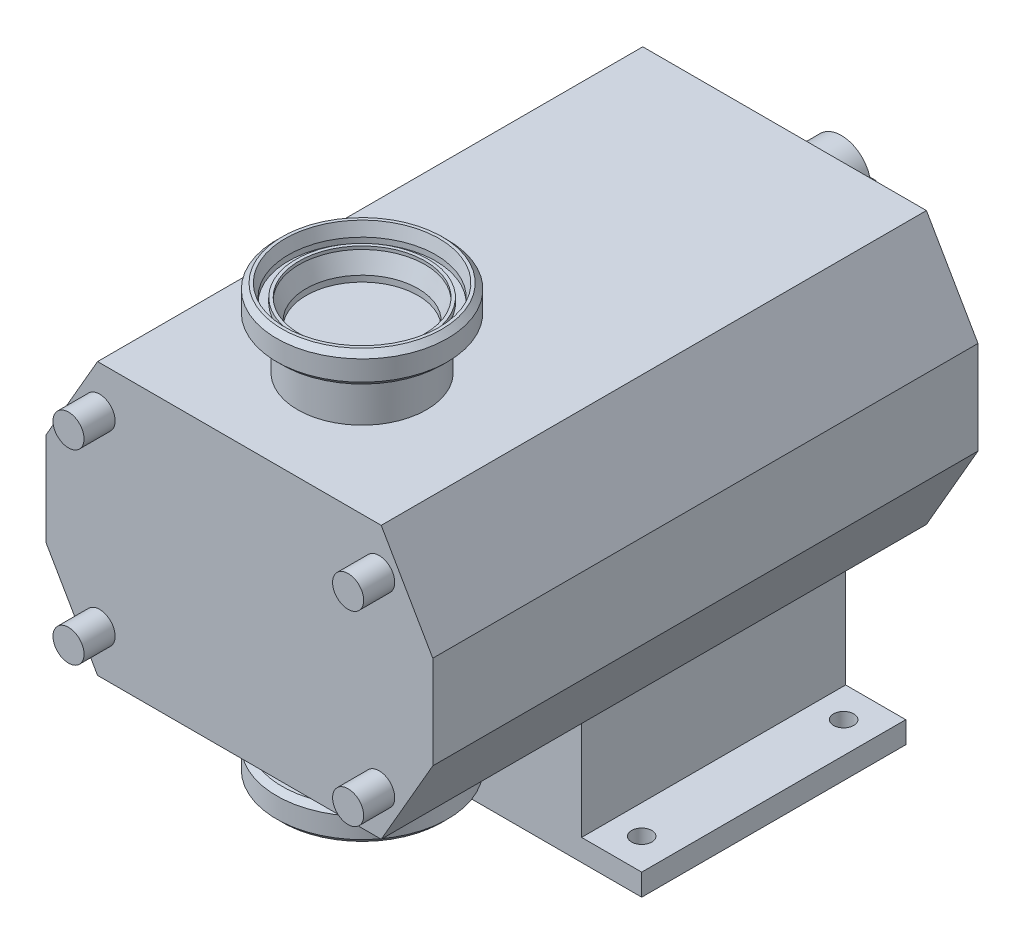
ISO-10303-21;
HEADER;
FILE_DESCRIPTION(('STEP AP214'),'2;1');
FILE_NAME('part.step','',(''),(''),'','','');
FILE_SCHEMA(('AUTOMOTIVE_DESIGN { 1 0 10303 214 1 1 1 1 }'));
ENDSEC;
DATA;
#1=APPLICATION_CONTEXT('core data for automotive mechanical design processes');
#2=APPLICATION_PROTOCOL_DEFINITION('international standard','automotive_design',2000,#1);
#3=PRODUCT_CONTEXT('',#1,'mechanical');
#4=PRODUCT('Part','Part','',(#3));
#5=PRODUCT_RELATED_PRODUCT_CATEGORY('part','',(#4));
#6=PRODUCT_DEFINITION_FORMATION('','',#4);
#7=PRODUCT_DEFINITION_CONTEXT('part definition',#1,'design');
#8=PRODUCT_DEFINITION('design','',#6,#7);
#9=PRODUCT_DEFINITION_SHAPE('','',#8);
#10=(LENGTH_UNIT() NAMED_UNIT(*) SI_UNIT(.MILLI.,.METRE.));
#11=(NAMED_UNIT(*) PLANE_ANGLE_UNIT() SI_UNIT($,.RADIAN.));
#12=(NAMED_UNIT(*) SI_UNIT($,.STERADIAN.) SOLID_ANGLE_UNIT());
#13=UNCERTAINTY_MEASURE_WITH_UNIT(LENGTH_MEASURE(1.E-05),#10,'distance_accuracy_value','');
#14=(GEOMETRIC_REPRESENTATION_CONTEXT(3) GLOBAL_UNCERTAINTY_ASSIGNED_CONTEXT((#13)) GLOBAL_UNIT_ASSIGNED_CONTEXT((#10,
#11,#12)) REPRESENTATION_CONTEXT('',''));
#15=CARTESIAN_POINT('',(0.,0.,0.));
#16=DIRECTION('',(0.,0.,1.));
#17=DIRECTION('',(1.,0.,0.));
#18=AXIS2_PLACEMENT_3D('',#15,#16,#17);
#19=CARTESIAN_POINT('',(-42.5,-126.,272.));
#20=DIRECTION('',(0.,-1.,0.));
#21=DIRECTION('',(0.,0.,1.));
#22=AXIS2_PLACEMENT_3D('',#19,#20,#21);
#23=PLANE('',#22);
#24=CARTESIAN_POINT('',(0.,-126.,272.));
#25=DIRECTION('',(0.,1.,0.));
#26=DIRECTION('',(0.,0.,-1.));
#27=AXIS2_PLACEMENT_3D('',#24,#25,#26);
#28=CIRCLE('',#27,42.5);
#29=CARTESIAN_POINT('',(0.,-126.,229.5));
#30=VERTEX_POINT('',#29);
#31=EDGE_CURVE('P0_E67',#30,#30,#28,.T.);
#32=ORIENTED_EDGE('',*,*,#31,.T.);
#33=EDGE_LOOP('',(#32));
#34=FACE_BOUND('',#33,.T.);
#35=CARTESIAN_POINT('',(0.,-126.,272.));
#36=DIRECTION('',(0.,1.,0.));
#37=DIRECTION('',(0.,0.,-1.));
#38=AXIS2_PLACEMENT_3D('',#35,#36,#37);
#39=CIRCLE('',#38,47.4);
#40=CARTESIAN_POINT('',(0.,-126.,224.6));
#41=VERTEX_POINT('',#40);
#42=EDGE_CURVE('P0_E10',#41,#41,#39,.T.);
#43=ORIENTED_EDGE('',*,*,#42,.F.);
#44=EDGE_LOOP('',(#43));
#45=FACE_BOUND('',#44,.T.);
#46=ADVANCED_FACE('P0_F15',(#34,#45),#23,.T.);
#47=CARTESIAN_POINT('',(0.,-112.5,272.));
#48=DIRECTION('',(0.,1.,0.));
#49=DIRECTION('',(0.,0.,-1.));
#50=AXIS2_PLACEMENT_3D('',#47,#48,#49);
#51=CYLINDRICAL_SURFACE('',#50,47.4);
#52=ORIENTED_EDGE('',*,*,#42,.T.);
#53=EDGE_LOOP('',(#52));
#54=FACE_BOUND('',#53,.T.);
#55=CARTESIAN_POINT('',(0.,-129.5,272.));
#56=DIRECTION('',(0.,1.,0.));
#57=DIRECTION('',(0.,0.,-1.));
#58=AXIS2_PLACEMENT_3D('',#55,#56,#57);
#59=CIRCLE('',#58,47.4);
#60=CARTESIAN_POINT('',(0.,-129.5,224.6));
#61=VERTEX_POINT('',#60);
#62=EDGE_CURVE('P0_E21',#61,#61,#59,.T.);
#63=ORIENTED_EDGE('',*,*,#62,.F.);
#64=EDGE_LOOP('',(#63));
#65=FACE_BOUND('',#64,.T.);
#66=ADVANCED_FACE('P0_F86',(#54,#65),#51,.F.);
#67=CARTESIAN_POINT('',(0.,-137.5,272.));
#68=DIRECTION('',(0.,-1.,0.));
#69=DIRECTION('',(0.,0.,1.));
#70=AXIS2_PLACEMENT_3D('',#67,#68,#69);
#71=CONICAL_SURFACE('',#70,49.543593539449,0.26179938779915);
#72=ORIENTED_EDGE('',*,*,#62,.T.);
#73=EDGE_LOOP('',(#72));
#74=FACE_BOUND('',#73,.T.);
#75=CARTESIAN_POINT('',(0.,-137.5,272.));
#76=DIRECTION('',(0.,1.,0.));
#77=DIRECTION('',(0.,0.,-1.));
#78=AXIS2_PLACEMENT_3D('',#75,#76,#77);
#79=CIRCLE('',#78,49.543593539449);
#80=CARTESIAN_POINT('',(0.,-137.5,222.456406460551));
#81=VERTEX_POINT('',#80);
#82=EDGE_CURVE('P0_E25',#81,#81,#79,.T.);
#83=ORIENTED_EDGE('',*,*,#82,.F.);
#84=EDGE_LOOP('',(#83));
#85=FACE_BOUND('',#84,.T.);
#86=ADVANCED_FACE('P0_F90',(#74,#85),#71,.F.);
#87=CARTESIAN_POINT('',(-49.5435935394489,-137.5,272.));
#88=DIRECTION('',(0.,-1.,0.));
#89=DIRECTION('',(0.,0.,1.));
#90=AXIS2_PLACEMENT_3D('',#87,#88,#89);
#91=PLANE('',#90);
#92=ORIENTED_EDGE('',*,*,#82,.T.);
#93=EDGE_LOOP('',(#92));
#94=FACE_BOUND('',#93,.T.);
#95=CARTESIAN_POINT('',(0.,-137.5,272.));
#96=DIRECTION('',(0.,1.,0.));
#97=DIRECTION('',(0.,0.,-1.));
#98=AXIS2_PLACEMENT_3D('',#95,#96,#97);
#99=CIRCLE('',#98,51.5);
#100=CARTESIAN_POINT('',(0.,-137.5,220.5));
#101=VERTEX_POINT('',#100);
#102=EDGE_CURVE('P0_E29',#101,#101,#99,.T.);
#103=ORIENTED_EDGE('',*,*,#102,.F.);
#104=EDGE_LOOP('',(#103));
#105=FACE_BOUND('',#104,.T.);
#106=ADVANCED_FACE('P0_F94',(#94,#105),#91,.T.);
#107=CARTESIAN_POINT('',(0.,-134.,272.));
#108=DIRECTION('',(0.,1.,0.));
#109=DIRECTION('',(0.,0.,-1.));
#110=AXIS2_PLACEMENT_3D('',#107,#108,#109);
#111=CONICAL_SURFACE('',#110,55.,0.785398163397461);
#112=ORIENTED_EDGE('',*,*,#102,.T.);
#113=EDGE_LOOP('',(#112));
#114=FACE_BOUND('',#113,.T.);
#115=CARTESIAN_POINT('',(0.,-134.,272.));
#116=DIRECTION('',(0.,1.,0.));
#117=DIRECTION('',(0.,0.,-1.));
#118=AXIS2_PLACEMENT_3D('',#115,#116,#117);
#119=CIRCLE('',#118,55.);
#120=CARTESIAN_POINT('',(0.,-134.,217.));
#121=VERTEX_POINT('',#120);
#122=EDGE_CURVE('P0_E34',#121,#121,#119,.T.);
#123=ORIENTED_EDGE('',*,*,#122,.F.);
#124=EDGE_LOOP('',(#123));
#125=FACE_BOUND('',#124,.T.);
#126=ADVANCED_FACE('P0_F100',(#114,#125),#111,.T.);
#127=CARTESIAN_POINT('',(0.,-112.5,272.));
#128=DIRECTION('',(0.,1.,0.));
#129=DIRECTION('',(0.,0.,-1.));
#130=AXIS2_PLACEMENT_3D('',#127,#128,#129);
#131=CYLINDRICAL_SURFACE('',#130,55.);
#132=ORIENTED_EDGE('',*,*,#122,.T.);
#133=EDGE_LOOP('',(#132));
#134=FACE_BOUND('',#133,.T.);
#135=CARTESIAN_POINT('',(0.,-121.,272.));
#136=DIRECTION('',(0.,1.,0.));
#137=DIRECTION('',(0.,0.,-1.));
#138=AXIS2_PLACEMENT_3D('',#135,#136,#137);
#139=CIRCLE('',#138,55.);
#140=CARTESIAN_POINT('',(0.,-121.,217.));
#141=VERTEX_POINT('',#140);
#142=EDGE_CURVE('P0_E37',#141,#141,#139,.T.);
#143=ORIENTED_EDGE('',*,*,#142,.F.);
#144=EDGE_LOOP('',(#143));
#145=FACE_BOUND('',#144,.T.);
#146=ADVANCED_FACE('P0_F104',(#134,#145),#131,.T.);
#147=CARTESIAN_POINT('',(0.,-117.5,272.));
#148=DIRECTION('',(0.,-1.,0.));
#149=DIRECTION('',(0.,0.,1.));
#150=AXIS2_PLACEMENT_3D('',#147,#148,#149);
#151=CONICAL_SURFACE('',#150,51.5,0.785398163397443);
#152=ORIENTED_EDGE('',*,*,#142,.T.);
#153=EDGE_LOOP('',(#152));
#154=FACE_BOUND('',#153,.T.);
#155=CARTESIAN_POINT('',(0.,-117.5,272.));
#156=DIRECTION('',(0.,1.,0.));
#157=DIRECTION('',(0.,0.,-1.));
#158=AXIS2_PLACEMENT_3D('',#155,#156,#157);
#159=CIRCLE('',#158,51.5);
#160=CARTESIAN_POINT('',(0.,-117.5,220.5));
#161=VERTEX_POINT('',#160);
#162=EDGE_CURVE('P0_E40',#161,#161,#159,.T.);
#163=ORIENTED_EDGE('',*,*,#162,.F.);
#164=EDGE_LOOP('',(#163));
#165=FACE_BOUND('',#164,.T.);
#166=ADVANCED_FACE('P0_F108',(#154,#165),#151,.T.);
#167=CARTESIAN_POINT('',(-51.5,-117.5,272.));
#168=DIRECTION('',(0.,1.,0.));
#169=DIRECTION('',(0.,0.,-1.));
#170=AXIS2_PLACEMENT_3D('',#167,#168,#169);
#171=PLANE('',#170);
#172=ORIENTED_EDGE('',*,*,#162,.T.);
#173=EDGE_LOOP('',(#172));
#174=FACE_BOUND('',#173,.T.);
#175=CARTESIAN_POINT('',(0.,-117.5,272.));
#176=DIRECTION('',(0.,1.,0.));
#177=DIRECTION('',(0.,0.,-1.));
#178=AXIS2_PLACEMENT_3D('',#175,#176,#177);
#179=CIRCLE('',#178,46.);
#180=CARTESIAN_POINT('',(0.,-117.5,226.));
#181=VERTEX_POINT('',#180);
#182=EDGE_CURVE('P0_E43',#181,#181,#179,.T.);
#183=ORIENTED_EDGE('',*,*,#182,.F.);
#184=EDGE_LOOP('',(#183));
#185=FACE_BOUND('',#184,.T.);
#186=ADVANCED_FACE('P0_F112',(#174,#185),#171,.T.);
#187=CARTESIAN_POINT('',(0.,-115.,272.));
#188=DIRECTION('',(0.,1.,0.));
#189=DIRECTION('',(0.,0.,-1.));
#190=AXIS2_PLACEMENT_3D('',#187,#188,#189);
#191=TOROIDAL_SURFACE('',#190,46.,2.5);
#192=ORIENTED_EDGE('',*,*,#182,.T.);
#193=EDGE_LOOP('',(#192));
#194=FACE_BOUND('',#193,.T.);
#195=CARTESIAN_POINT('',(0.,-115.,272.));
#196=DIRECTION('',(0.,1.,0.));
#197=DIRECTION('',(0.,0.,-1.));
#198=AXIS2_PLACEMENT_3D('',#195,#196,#197);
#199=CIRCLE('',#198,43.5);
#200=CARTESIAN_POINT('',(0.,-115.,228.5));
#201=VERTEX_POINT('',#200);
#202=EDGE_CURVE('P0_E46',#201,#201,#199,.T.);
#203=ORIENTED_EDGE('',*,*,#202,.F.);
#204=EDGE_LOOP('',(#203));
#205=FACE_BOUND('',#204,.T.);
#206=ADVANCED_FACE('P0_F116',(#194,#205),#191,.F.);
#207=CARTESIAN_POINT('',(0.,-112.5,272.));
#208=DIRECTION('',(0.,1.,0.));
#209=DIRECTION('',(0.,0.,-1.));
#210=AXIS2_PLACEMENT_3D('',#207,#208,#209);
#211=CYLINDRICAL_SURFACE('',#210,43.5);
#212=ORIENTED_EDGE('',*,*,#202,.T.);
#213=EDGE_LOOP('',(#212));
#214=FACE_BOUND('',#213,.T.);
#215=CARTESIAN_POINT('',(0.,-112.5,272.));
#216=DIRECTION('',(0.,1.,0.));
#217=DIRECTION('',(0.,0.,-1.));
#218=AXIS2_PLACEMENT_3D('',#215,#216,#217);
#219=CIRCLE('',#218,43.5);
#220=CARTESIAN_POINT('',(0.,-112.5,228.5));
#221=VERTEX_POINT('',#220);
#222=EDGE_CURVE('P0_E49',#221,#221,#219,.T.);
#223=ORIENTED_EDGE('',*,*,#222,.F.);
#224=EDGE_LOOP('',(#223));
#225=FACE_BOUND('',#224,.T.);
#226=ADVANCED_FACE('P0_F120',(#214,#225),#211,.T.);
#227=CARTESIAN_POINT('',(-36.,-112.5,272.));
#228=DIRECTION('',(0.,1.,0.));
#229=DIRECTION('',(0.,0.,-1.));
#230=AXIS2_PLACEMENT_3D('',#227,#228,#229);
#231=PLANE('',#230);
#232=ORIENTED_EDGE('',*,*,#222,.T.);
#233=EDGE_LOOP('',(#232));
#234=FACE_BOUND('',#233,.T.);
#235=CARTESIAN_POINT('',(0.,-112.5,272.));
#236=DIRECTION('',(0.,1.,0.));
#237=DIRECTION('',(0.,0.,-1.));
#238=AXIS2_PLACEMENT_3D('',#235,#236,#237);
#239=CIRCLE('',#238,36.);
#240=CARTESIAN_POINT('',(0.,-112.5,236.));
#241=VERTEX_POINT('',#240);
#242=EDGE_CURVE('P0_E52',#241,#241,#239,.T.);
#243=ORIENTED_EDGE('',*,*,#242,.F.);
#244=EDGE_LOOP('',(#243));
#245=FACE_BOUND('',#244,.T.);
#246=ADVANCED_FACE('P0_F124',(#234,#245),#231,.T.);
#247=CARTESIAN_POINT('',(0.,-112.5,272.));
#248=DIRECTION('',(0.,1.,0.));
#249=DIRECTION('',(0.,0.,-1.));
#250=AXIS2_PLACEMENT_3D('',#247,#248,#249);
#251=CYLINDRICAL_SURFACE('',#250,36.);
#252=ORIENTED_EDGE('',*,*,#242,.T.);
#253=EDGE_LOOP('',(#252));
#254=FACE_BOUND('',#253,.T.);
#255=CARTESIAN_POINT('',(0.,-116.362109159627,272.));
#256=DIRECTION('',(0.,1.,0.));
#257=DIRECTION('',(0.,0.,-1.));
#258=AXIS2_PLACEMENT_3D('',#255,#256,#257);
#259=CIRCLE('',#258,36.);
#260=CARTESIAN_POINT('',(0.,-116.362109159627,236.));
#261=VERTEX_POINT('',#260);
#262=EDGE_CURVE('P0_E55',#261,#261,#259,.T.);
#263=ORIENTED_EDGE('',*,*,#262,.F.);
#264=EDGE_LOOP('',(#263));
#265=FACE_BOUND('',#264,.T.);
#266=ADVANCED_FACE('P0_F128',(#254,#265),#251,.F.);
#267=CARTESIAN_POINT('',(0.,-127.5,272.));
#268=DIRECTION('',(0.,-1.,0.));
#269=DIRECTION('',(0.,0.,1.));
#270=AXIS2_PLACEMENT_3D('',#267,#268,#269);
#271=CONICAL_SURFACE('',#270,40.5,0.383972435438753);
#272=ORIENTED_EDGE('',*,*,#262,.T.);
#273=EDGE_LOOP('',(#272));
#274=FACE_BOUND('',#273,.T.);
#275=CARTESIAN_POINT('',(0.,-127.5,272.));
#276=DIRECTION('',(0.,1.,0.));
#277=DIRECTION('',(0.,0.,-1.));
#278=AXIS2_PLACEMENT_3D('',#275,#276,#277);
#279=CIRCLE('',#278,40.5);
#280=CARTESIAN_POINT('',(0.,-127.5,231.5));
#281=VERTEX_POINT('',#280);
#282=EDGE_CURVE('P0_E58',#281,#281,#279,.T.);
#283=ORIENTED_EDGE('',*,*,#282,.F.);
#284=EDGE_LOOP('',(#283));
#285=FACE_BOUND('',#284,.T.);
#286=ADVANCED_FACE('P0_F132',(#274,#285),#271,.F.);
#287=CARTESIAN_POINT('',(0.,-112.5,272.));
#288=DIRECTION('',(0.,1.,0.));
#289=DIRECTION('',(0.,0.,-1.));
#290=AXIS2_PLACEMENT_3D('',#287,#288,#289);
#291=CYLINDRICAL_SURFACE('',#290,40.5);
#292=ORIENTED_EDGE('',*,*,#282,.T.);
#293=EDGE_LOOP('',(#292));
#294=FACE_BOUND('',#293,.T.);
#295=CARTESIAN_POINT('',(0.,-129.5,272.));
#296=DIRECTION('',(0.,1.,0.));
#297=DIRECTION('',(0.,0.,-1.));
#298=AXIS2_PLACEMENT_3D('',#295,#296,#297);
#299=CIRCLE('',#298,40.5);
#300=CARTESIAN_POINT('',(0.,-129.5,231.5));
#301=VERTEX_POINT('',#300);
#302=EDGE_CURVE('P0_E61',#301,#301,#299,.T.);
#303=ORIENTED_EDGE('',*,*,#302,.F.);
#304=EDGE_LOOP('',(#303));
#305=FACE_BOUND('',#304,.T.);
#306=ADVANCED_FACE('P0_F82',(#294,#305),#291,.F.);
#307=CARTESIAN_POINT('',(-40.5,-129.5,272.));
#308=DIRECTION('',(0.,-1.,0.));
#309=DIRECTION('',(0.,0.,1.));
#310=AXIS2_PLACEMENT_3D('',#307,#308,#309);
#311=PLANE('',#310);
#312=ORIENTED_EDGE('',*,*,#302,.T.);
#313=EDGE_LOOP('',(#312));
#314=FACE_BOUND('',#313,.T.);
#315=CARTESIAN_POINT('',(0.,-129.5,272.));
#316=DIRECTION('',(0.,1.,0.));
#317=DIRECTION('',(0.,0.,-1.));
#318=AXIS2_PLACEMENT_3D('',#315,#316,#317);
#319=CIRCLE('',#318,42.5);
#320=CARTESIAN_POINT('',(0.,-129.5,229.5));
#321=VERTEX_POINT('',#320);
#322=EDGE_CURVE('P0_E64',#321,#321,#319,.T.);
#323=ORIENTED_EDGE('',*,*,#322,.F.);
#324=EDGE_LOOP('',(#323));
#325=FACE_BOUND('',#324,.T.);
#326=ADVANCED_FACE('P0_F75',(#314,#325),#311,.T.);
#327=CARTESIAN_POINT('',(0.,-112.5,272.));
#328=DIRECTION('',(0.,1.,0.));
#329=DIRECTION('',(0.,0.,-1.));
#330=AXIS2_PLACEMENT_3D('',#327,#328,#329);
#331=CYLINDRICAL_SURFACE('',#330,42.5);
#332=ORIENTED_EDGE('',*,*,#322,.T.);
#333=EDGE_LOOP('',(#332));
#334=FACE_BOUND('',#333,.T.);
#335=ORIENTED_EDGE('',*,*,#31,.F.);
#336=EDGE_LOOP('',(#335));
#337=FACE_BOUND('',#336,.T.);
#338=ADVANCED_FACE('P0_F73',(#334,#337),#331,.T.);
#339=CLOSED_SHELL('',(#46,#66,#86,#106,#126,#146,#166,#186,#206,#226,#246,#266,#286,#306,#326,#338));
#340=MANIFOLD_SOLID_BREP('P0_B1',#339);
#341=CARTESIAN_POINT('',(-46.5,0.,241.732657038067));
#342=DIRECTION('',(0.,0.,1.));
#343=DIRECTION('',(1.,0.,0.));
#344=AXIS2_PLACEMENT_3D('',#341,#342,#343);
#345=CYLINDRICAL_SURFACE('',#344,19.);
#346=CARTESIAN_POINT('',(-46.5,0.,-3.));
#347=DIRECTION('',(0.,0.,1.));
#348=DIRECTION('',(1.,0.,0.));
#349=AXIS2_PLACEMENT_3D('',#346,#347,#348);
#350=CIRCLE('',#349,19.);
#351=CARTESIAN_POINT('',(-27.5,0.,-3.));
#352=VERTEX_POINT('',#351);
#353=EDGE_CURVE('P1_E277',#352,#352,#350,.T.);
#354=ORIENTED_EDGE('',*,*,#353,.F.);
#355=EDGE_LOOP('',(#354));
#356=FACE_BOUND('',#355,.T.);
#357=DIRECTION('',(0.,0.,1.));
#358=VECTOR('',#357,1.);
#359=CARTESIAN_POINT('',(-28.1696972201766,4.99999999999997,241.732657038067));
#360=LINE('',#359,#358);
#361=CARTESIAN_POINT('',(-28.1696972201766,5.,-83.));
#362=VERTEX_POINT('',#361);
#363=CARTESIAN_POINT('',(-28.1696972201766,5.,-43.));
#364=VERTEX_POINT('',#363);
#365=EDGE_CURVE('P1_E178',#362,#364,#360,.T.);
#366=ORIENTED_EDGE('',*,*,#365,.F.);
#367=CARTESIAN_POINT('',(-46.5,0.,-83.));
#368=DIRECTION('',(0.,0.,1.));
#369=DIRECTION('',(1.,0.,0.));
#370=AXIS2_PLACEMENT_3D('',#367,#368,#369);
#371=CIRCLE('',#370,19.);
#372=CARTESIAN_POINT('',(-28.1696972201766,-5.,-83.));
#373=VERTEX_POINT('',#372);
#374=EDGE_CURVE('P1_E176',#362,#373,#371,.T.);
#375=ORIENTED_EDGE('',*,*,#374,.T.);
#376=DIRECTION('',(0.,0.,1.));
#377=VECTOR('',#376,1.);
#378=CARTESIAN_POINT('',(-28.1696972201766,-5.00000000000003,241.732657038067));
#379=LINE('',#378,#377);
#380=CARTESIAN_POINT('',(-28.1696972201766,-5.00000000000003,-43.));
#381=VERTEX_POINT('',#380);
#382=EDGE_CURVE('P1_E39',#381,#373,#379,.F.);
#383=ORIENTED_EDGE('',*,*,#382,.F.);
#384=CARTESIAN_POINT('',(-27.5,0.,-48.));
#385=CARTESIAN_POINT('',(-27.5000042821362,0.275769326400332,-47.9999931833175));
#386=CARTESIAN_POINT('',(-27.5060630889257,0.551612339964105,-47.9771088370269));
#387=CARTESIAN_POINT('',(-27.5296447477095,1.09536084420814,-47.8863327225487));
#388=CARTESIAN_POINT('',(-27.5471733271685,1.36326229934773,-47.8184184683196));
#389=CARTESIAN_POINT('',(-27.5917584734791,1.88319959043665,-47.6399368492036));
#390=CARTESIAN_POINT('',(-27.6188029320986,2.13525511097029,-47.5294236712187));
#391=CARTESIAN_POINT('',(-27.6795569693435,2.61725305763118,-47.2690799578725));
#392=CARTESIAN_POINT('',(-27.7132669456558,2.84719416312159,-47.1192470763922));
#393=CARTESIAN_POINT('',(-27.7845611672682,3.28363987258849,-46.7809367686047));
#394=CARTESIAN_POINT('',(-27.8222102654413,3.48957269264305,-46.591735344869));
#395=CARTESIAN_POINT('',(-27.8967199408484,3.86718169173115,-46.1816068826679));
#396=CARTESIAN_POINT('',(-27.9335804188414,4.03885358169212,-45.9606758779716));
#397=CARTESIAN_POINT('',(-28.0030006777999,4.34583417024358,-45.4888224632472));
#398=CARTESIAN_POINT('',(-28.0354785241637,4.48048899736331,-45.237461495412));
#399=CARTESIAN_POINT('',(-28.0915043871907,4.7054029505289,-44.7146757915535));
#400=CARTESIAN_POINT('',(-28.1150540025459,4.79567002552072,-44.4432546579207));
#401=CARTESIAN_POINT('',(-28.1498881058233,4.92726790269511,-43.8943761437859));
#402=CARTESIAN_POINT('',(-28.1614315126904,4.96963355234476,-43.6171837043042));
#403=CARTESIAN_POINT('',(-28.171720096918,5.00745164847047,-43.0594039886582));
#404=CARTESIAN_POINT('',(-28.1704675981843,5.00291261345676,-42.7788173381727));
#405=CARTESIAN_POINT('',(-28.1555378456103,4.9478726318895,-42.2302595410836));
#406=CARTESIAN_POINT('',(-28.1421979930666,4.89861973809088,-41.9621525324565));
#407=CARTESIAN_POINT('',(-28.1051362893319,4.75754734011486,-41.4381479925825));
#408=CARTESIAN_POINT('',(-28.0814136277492,4.6657245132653,-41.1822514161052));
#409=CARTESIAN_POINT('',(-28.0259597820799,4.4410917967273,-40.6866584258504));
#410=CARTESIAN_POINT('',(-27.9941431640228,4.30784106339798,-40.4471717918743));
#411=CARTESIAN_POINT('',(-27.926132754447,4.00444274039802,-39.9935172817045));
#412=CARTESIAN_POINT('',(-27.8899381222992,3.83428805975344,-39.7793542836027));
#413=CARTESIAN_POINT('',(-27.8158419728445,3.45551254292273,-39.3752910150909));
#414=CARTESIAN_POINT('',(-27.7779227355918,3.24584253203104,-39.1863761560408));
#415=CARTESIAN_POINT('',(-27.705680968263,2.79733618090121,-38.8461906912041));
#416=CARTESIAN_POINT('',(-27.671358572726,2.55849875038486,-38.6949214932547));
#417=CARTESIAN_POINT('',(-27.6099756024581,2.05693717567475,-38.4339031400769));
#418=CARTESIAN_POINT('',(-27.5829456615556,1.79411828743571,-38.3243283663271));
#419=CARTESIAN_POINT('',(-27.5394148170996,1.25291705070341,-38.151199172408));
#420=CARTESIAN_POINT('',(-27.5229116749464,0.974538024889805,-38.0876349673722));
#421=CARTESIAN_POINT('',(-27.5026308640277,0.418531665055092,-38.009869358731));
#422=CARTESIAN_POINT('',(-27.4985077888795,0.141104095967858,-37.9943277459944));
#423=CARTESIAN_POINT('',(-27.5024606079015,-0.41239217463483,-38.0093527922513));
#424=CARTESIAN_POINT('',(-27.5105352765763,-0.688461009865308,-38.0399148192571));
#425=CARTESIAN_POINT('',(-27.5377535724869,-1.22664703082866,-38.1451790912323));
#426=CARTESIAN_POINT('',(-27.5567105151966,-1.48892004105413,-38.2191373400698));
#427=CARTESIAN_POINT('',(-27.6035461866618,-1.99731390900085,-38.4082337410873));
#428=CARTESIAN_POINT('',(-27.6314258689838,-2.24343303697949,-38.5233762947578));
#429=CARTESIAN_POINT('',(-27.6938277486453,-2.71776721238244,-38.7940826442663));
#430=CARTESIAN_POINT('',(-27.7284672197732,-2.94554769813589,-38.9503801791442));
#431=CARTESIAN_POINT('',(-27.8003827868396,-3.3721194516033,-39.298034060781));
#432=CARTESIAN_POINT('',(-27.8376593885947,-3.5709051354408,-39.4893971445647));
#433=CARTESIAN_POINT('',(-27.9119129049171,-3.93946537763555,-39.9079980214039));
#434=CARTESIAN_POINT('',(-27.9488536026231,-4.10829545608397,-40.1360753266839));
#435=CARTESIAN_POINT('',(-28.0171260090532,-4.40530154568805,-40.6181009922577));
#436=CARTESIAN_POINT('',(-28.048457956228,-4.5334792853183,-40.8720482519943));
#437=CARTESIAN_POINT('',(-28.1016076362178,-4.74457728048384,-41.3973124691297));
#438=CARTESIAN_POINT('',(-28.1234807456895,-4.82776168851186,-41.6685173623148));
#439=CARTESIAN_POINT('',(-28.1552579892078,-4.94715371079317,-42.2217364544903));
#440=CARTESIAN_POINT('',(-28.1651650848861,-4.98337294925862,-42.5037479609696));
#441=CARTESIAN_POINT('',(-28.1716457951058,-5.00715081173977,-43.0609183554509));
#442=CARTESIAN_POINT('',(-28.1686348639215,-4.99622557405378,-43.3360086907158));
#443=CARTESIAN_POINT('',(-28.1505888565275,-4.92953140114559,-43.8802760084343));
#444=CARTESIAN_POINT('',(-28.1355540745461,-4.87376356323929,-44.1494531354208));
#445=CARTESIAN_POINT('',(-28.095398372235,-4.71983552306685,-44.6724009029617));
#446=CARTESIAN_POINT('',(-28.0703520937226,-4.6219886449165,-44.9262699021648));
#447=CARTESIAN_POINT('',(-28.012991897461,-4.38692411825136,-45.4141783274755));
#448=CARTESIAN_POINT('',(-27.9806768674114,-4.24970044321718,-45.648214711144));
#449=CARTESIAN_POINT('',(-27.9112611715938,-3.93514861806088,-46.0970708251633));
#450=CARTESIAN_POINT('',(-27.8740497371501,-3.7567820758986,-46.3111458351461));
#451=CARTESIAN_POINT('',(-27.7996615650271,-3.36699304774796,-46.7068188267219));
#452=CARTESIAN_POINT('',(-27.7624848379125,-3.15556257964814,-46.8884089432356));
#453=CARTESIAN_POINT('',(-27.6914364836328,-2.7003741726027,-47.2176404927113));
#454=CARTESIAN_POINT('',(-27.6576490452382,-2.45603841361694,-47.3645027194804));
#455=CARTESIAN_POINT('',(-27.5980996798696,-1.94526775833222,-47.6148349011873));
#456=CARTESIAN_POINT('',(-27.5723324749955,-1.67884754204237,-47.7183334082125));
#457=CARTESIAN_POINT('',(-27.5351625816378,-1.17775159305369,-47.8650961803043));
#458=CARTESIAN_POINT('',(-27.5220714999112,-0.94528670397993,-47.9155694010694));
#459=CARTESIAN_POINT('',(-27.5044887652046,-0.475232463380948,-47.9830226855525));
#460=CARTESIAN_POINT('',(-27.4999963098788,-0.237643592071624,-48.0000058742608));
#461=CARTESIAN_POINT('',(-27.5,0.,-48.));
#462=B_SPLINE_CURVE_WITH_KNOTS('',3,(#384,#385,#386,#387,#388,#389,#390,#391,#392,#393,#394,
#395,#396,#397,#398,#399,#400,#401,#402,#403,#404,#405,#406,#407,#408,#409,#410,#411,#412,#413,
#414,#415,#416,#417,#418,#419,#420,#421,#422,#423,#424,#425,#426,#427,#428,#429,#430,#431,#432,
#433,#434,#435,#436,#437,#438,#439,#440,#441,#442,#443,#444,#445,#446,#447,#448,#449,#450,#451,
#452,#453,#454,#455,#456,#457,#458,#459,#460,#461),.UNSPECIFIED.,.T.,.F.,(4,2,2,2,2,2,2,2,2,2,2,
2,2,2,2,2,2,2,2,2,2,2,2,2,2,2,2,2,2,2,2,2,2,2,2,2,2,2,4),(0.,0.826436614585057,1.65328622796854,
2.47908752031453,3.30493809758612,4.14758534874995,4.99033802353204,5.84713921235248,
6.70378690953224,7.54155141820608,8.37916378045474,9.19409222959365,10.0090842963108,
10.8330642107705,11.6572025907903,12.5074895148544,13.35780823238,14.2116451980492,
15.0653005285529,15.8949065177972,16.7244291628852,17.5401294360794,18.3559169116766,
19.187369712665,20.0189824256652,20.873388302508,21.7277578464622,22.577055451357,
23.4261428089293,24.2481310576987,25.0700991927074,25.8860500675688,26.702125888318,
27.5416338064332,28.3813447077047,29.2384104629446,30.0949110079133,30.8071573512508,
31.5193372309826),.UNSPECIFIED.);
#463=EDGE_CURVE('P1_E11',#364,#381,#462,.T.);
#464=ORIENTED_EDGE('',*,*,#463,.F.);
#465=EDGE_LOOP('',(#366,#375,#383,#464));
#466=FACE_BOUND('',#465,.T.);
#467=ADVANCED_FACE('P1_F17',(#356,#466),#345,.T.);
#468=CARTESIAN_POINT('',(-91.3023595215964,-87.5,351.));
#469=DIRECTION('',(0.,1.,0.));
#470=DIRECTION('',(-1.,0.,0.));
#471=AXIS2_PLACEMENT_3D('',#468,#469,#470);
#472=PLANE('',#471);
#473=CARTESIAN_POINT('',(0.,-87.5,272.));
#474=DIRECTION('',(0.,1.,0.));
#475=DIRECTION('',(-1.,0.,0.));
#476=AXIS2_PLACEMENT_3D('',#473,#474,#475);
#477=CIRCLE('',#476,41.5);
#478=CARTESIAN_POINT('',(-41.4999999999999,-87.5,272.));
#479=VERTEX_POINT('',#478);
#480=EDGE_CURVE('P1_E192',#479,#479,#477,.T.);
#481=ORIENTED_EDGE('',*,*,#480,.T.);
#482=EDGE_LOOP('',(#481));
#483=FACE_BOUND('',#482,.T.);
#484=DIRECTION('',(1.,0.,0.));
#485=VECTOR('',#484,1.);
#486=CARTESIAN_POINT('',(-91.3023595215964,-87.5,0.));
#487=LINE('',#486,#485);
#488=CARTESIAN_POINT('',(-91.3023595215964,-87.5,0.));
#489=VERTEX_POINT('',#488);
#490=CARTESIAN_POINT('',(91.3023595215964,-87.5,0.));
#491=VERTEX_POINT('',#490);
#492=EDGE_CURVE('P1_E337',#489,#491,#487,.T.);
#493=ORIENTED_EDGE('',*,*,#492,.T.);
#494=DIRECTION('',(0.,0.,-1.));
#495=VECTOR('',#494,1.);
#496=CARTESIAN_POINT('',(91.3023595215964,-87.5,351.));
#497=LINE('',#496,#495);
#498=CARTESIAN_POINT('',(91.3023595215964,-87.5,351.));
#499=VERTEX_POINT('',#498);
#500=EDGE_CURVE('P1_E347',#499,#491,#497,.T.);
#501=ORIENTED_EDGE('',*,*,#500,.F.);
#502=DIRECTION('',(1.,0.,0.));
#503=VECTOR('',#502,1.);
#504=CARTESIAN_POINT('',(-91.3023595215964,-87.5,351.));
#505=LINE('',#504,#503);
#506=CARTESIAN_POINT('',(-91.3023595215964,-87.5,351.));
#507=VERTEX_POINT('',#506);
#508=EDGE_CURVE('P1_E320',#507,#499,#505,.T.);
#509=ORIENTED_EDGE('',*,*,#508,.F.);
#510=DIRECTION('',(0.,0.,-1.));
#511=VECTOR('',#510,1.);
#512=CARTESIAN_POINT('',(-91.3023595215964,-87.5,351.));
#513=LINE('',#512,#511);
#514=EDGE_CURVE('P1_E350',#507,#489,#513,.T.);
#515=ORIENTED_EDGE('',*,*,#514,.T.);
#516=EDGE_LOOP('',(#493,#501,#509,#515));
#517=FACE_BOUND('',#516,.T.);
#518=DIRECTION('',(1.,0.,0.));
#519=VECTOR('',#518,1.);
#520=CARTESIAN_POINT('',(66.3023595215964,-87.5,27.));
#521=LINE('',#520,#519);
#522=CARTESIAN_POINT('',(-66.3023595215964,-87.5,27.));
#523=VERTEX_POINT('',#522);
#524=CARTESIAN_POINT('',(66.3023595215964,-87.5,27.));
#525=VERTEX_POINT('',#524);
#526=EDGE_CURVE('P1_E220',#523,#525,#521,.T.);
#527=ORIENTED_EDGE('',*,*,#526,.F.);
#528=DIRECTION('',(0.,0.,1.));
#529=VECTOR('',#528,1.);
#530=CARTESIAN_POINT('',(-66.3023595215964,-87.5,27.));
#531=LINE('',#530,#529);
#532=CARTESIAN_POINT('',(-66.3023595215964,-87.5,197.));
#533=VERTEX_POINT('',#532);
#534=EDGE_CURVE('P1_E238',#523,#533,#531,.T.);
#535=ORIENTED_EDGE('',*,*,#534,.T.);
#536=DIRECTION('',(1.,0.,0.));
#537=VECTOR('',#536,1.);
#538=CARTESIAN_POINT('',(66.3023595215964,-87.5,197.));
#539=LINE('',#538,#537);
#540=CARTESIAN_POINT('',(66.3023595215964,-87.5,197.));
#541=VERTEX_POINT('',#540);
#542=EDGE_CURVE('P1_E219',#533,#541,#539,.T.);
#543=ORIENTED_EDGE('',*,*,#542,.T.);
#544=DIRECTION('',(0.,0.,1.));
#545=VECTOR('',#544,1.);
#546=CARTESIAN_POINT('',(66.3023595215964,-87.5,27.));
#547=LINE('',#546,#545);
#548=EDGE_CURVE('P1_E274',#525,#541,#547,.T.);
#549=ORIENTED_EDGE('',*,*,#548,.F.);
#550=EDGE_LOOP('',(#527,#535,#543,#549));
#551=FACE_BOUND('',#550,.T.);
#552=ADVANCED_FACE('P1_F393',(#483,#517,#551),#472,.F.);
#553=CARTESIAN_POINT('',(141.820508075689,0.,0.));
#554=DIRECTION('',(0.,0.,1.));
#555=DIRECTION('',(1.,0.,0.));
#556=AXIS2_PLACEMENT_3D('',#553,#554,#555);
#557=PLANE('',#556);
#558=DIRECTION('',(-0.500000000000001,0.866025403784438,0.));
#559=VECTOR('',#558,1.);
#560=CARTESIAN_POINT('',(91.3023595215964,87.5,0.));
#561=LINE('',#560,#559);
#562=CARTESIAN_POINT('',(124.5,30.,0.));
#563=VERTEX_POINT('',#562);
#564=CARTESIAN_POINT('',(91.3023595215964,87.5,0.));
#565=VERTEX_POINT('',#564);
#566=EDGE_CURVE('P1_E305',#563,#565,#561,.T.);
#567=ORIENTED_EDGE('',*,*,#566,.F.);
#568=DIRECTION('',(0.,1.,0.));
#569=VECTOR('',#568,1.);
#570=CARTESIAN_POINT('',(124.5,30.,0.));
#571=LINE('',#570,#569);
#572=CARTESIAN_POINT('',(124.5,-30.,0.));
#573=VERTEX_POINT('',#572);
#574=EDGE_CURVE('P1_E312',#573,#563,#571,.T.);
#575=ORIENTED_EDGE('',*,*,#574,.F.);
#576=DIRECTION('',(0.500000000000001,0.866025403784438,0.));
#577=VECTOR('',#576,1.);
#578=CARTESIAN_POINT('',(91.3023595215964,-87.5,0.));
#579=LINE('',#578,#577);
#580=EDGE_CURVE('P1_E339',#491,#573,#579,.T.);
#581=ORIENTED_EDGE('',*,*,#580,.F.);
#582=ORIENTED_EDGE('',*,*,#492,.F.);
#583=DIRECTION('',(0.500000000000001,-0.866025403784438,0.));
#584=VECTOR('',#583,1.);
#585=CARTESIAN_POINT('',(-91.3023595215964,-87.5,0.));
#586=LINE('',#585,#584);
#587=CARTESIAN_POINT('',(-124.5,-30.,0.));
#588=VERTEX_POINT('',#587);
#589=EDGE_CURVE('P1_E335',#588,#489,#586,.T.);
#590=ORIENTED_EDGE('',*,*,#589,.F.);
#591=DIRECTION('',(0.,-1.,0.));
#592=VECTOR('',#591,1.);
#593=CARTESIAN_POINT('',(-124.5,30.,0.));
#594=LINE('',#593,#592);
#595=CARTESIAN_POINT('',(-124.5,30.,0.));
#596=VERTEX_POINT('',#595);
#597=EDGE_CURVE('P1_E333',#596,#588,#594,.T.);
#598=ORIENTED_EDGE('',*,*,#597,.F.);
#599=DIRECTION('',(-0.500000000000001,-0.866025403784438,0.));
#600=VECTOR('',#599,1.);
#601=CARTESIAN_POINT('',(-91.3023595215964,87.5,0.));
#602=LINE('',#601,#600);
#603=CARTESIAN_POINT('',(-91.3023595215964,87.5,0.));
#604=VERTEX_POINT('',#603);
#605=EDGE_CURVE('P1_E331',#604,#596,#602,.T.);
#606=ORIENTED_EDGE('',*,*,#605,.F.);
#607=DIRECTION('',(-1.,0.,0.));
#608=VECTOR('',#607,1.);
#609=CARTESIAN_POINT('',(-91.3023595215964,87.5,0.));
#610=LINE('',#609,#608);
#611=EDGE_CURVE('P1_E329',#565,#604,#610,.T.);
#612=ORIENTED_EDGE('',*,*,#611,.F.);
#613=EDGE_LOOP('',(#567,#575,#581,#582,#590,#598,#606,#612));
#614=FACE_BOUND('',#613,.T.);
#615=CARTESIAN_POINT('',(-46.5,0.,0.));
#616=DIRECTION('',(0.,0.,1.));
#617=DIRECTION('',(1.,0.,0.));
#618=AXIS2_PLACEMENT_3D('',#615,#616,#617);
#619=CIRCLE('',#618,22.);
#620=CARTESIAN_POINT('',(-24.5,0.,0.));
#621=VERTEX_POINT('',#620);
#622=EDGE_CURVE('P1_E29',#621,#621,#619,.F.);
#623=ORIENTED_EDGE('',*,*,#622,.F.);
#624=EDGE_LOOP('',(#623));
#625=FACE_BOUND('',#624,.T.);
#626=ADVANCED_FACE('P1_F399',(#614,#625),#557,.F.);
#627=CARTESIAN_POINT('',(141.820508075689,0.,351.));
#628=DIRECTION('',(0.,0.,1.));
#629=DIRECTION('',(1.,0.,0.));
#630=AXIS2_PLACEMENT_3D('',#627,#628,#629);
#631=PLANE('',#630);
#632=CARTESIAN_POINT('',(90.,-60.,351.));
#633=DIRECTION('',(0.,0.,1.));
#634=DIRECTION('',(1.,0.,0.));
#635=AXIS2_PLACEMENT_3D('',#632,#633,#634);
#636=CIRCLE('',#635,9.99999999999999);
#637=CARTESIAN_POINT('',(100.,-60.,351.));
#638=VERTEX_POINT('',#637);
#639=EDGE_CURVE('P1_E287',#638,#638,#636,.T.);
#640=ORIENTED_EDGE('',*,*,#639,.F.);
#641=EDGE_LOOP('',(#640));
#642=FACE_BOUND('',#641,.T.);
#643=CARTESIAN_POINT('',(-90.,60.,351.));
#644=DIRECTION('',(0.,0.,1.));
#645=DIRECTION('',(1.,0.,0.));
#646=AXIS2_PLACEMENT_3D('',#643,#644,#645);
#647=CIRCLE('',#646,9.99999999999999);
#648=CARTESIAN_POINT('',(-80.,60.,351.));
#649=VERTEX_POINT('',#648);
#650=EDGE_CURVE('P1_E299',#649,#649,#647,.T.);
#651=ORIENTED_EDGE('',*,*,#650,.F.);
#652=EDGE_LOOP('',(#651));
#653=FACE_BOUND('',#652,.T.);
#654=DIRECTION('',(-0.500000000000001,0.866025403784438,0.));
#655=VECTOR('',#654,1.);
#656=CARTESIAN_POINT('',(91.3023595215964,87.5,351.));
#657=LINE('',#656,#655);
#658=CARTESIAN_POINT('',(124.5,30.,351.));
#659=VERTEX_POINT('',#658);
#660=CARTESIAN_POINT('',(91.3023595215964,87.5,351.));
#661=VERTEX_POINT('',#660);
#662=EDGE_CURVE('P1_E308',#659,#661,#657,.T.);
#663=ORIENTED_EDGE('',*,*,#662,.T.);
#664=DIRECTION('',(-1.,0.,0.));
#665=VECTOR('',#664,1.);
#666=CARTESIAN_POINT('',(-91.3023595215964,87.5,351.));
#667=LINE('',#666,#665);
#668=CARTESIAN_POINT('',(-91.3023595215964,87.5,351.));
#669=VERTEX_POINT('',#668);
#670=EDGE_CURVE('P1_E311',#661,#669,#667,.T.);
#671=ORIENTED_EDGE('',*,*,#670,.T.);
#672=DIRECTION('',(-0.500000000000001,-0.866025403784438,0.));
#673=VECTOR('',#672,1.);
#674=CARTESIAN_POINT('',(-91.3023595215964,87.5,351.));
#675=LINE('',#674,#673);
#676=CARTESIAN_POINT('',(-124.5,30.,351.));
#677=VERTEX_POINT('',#676);
#678=EDGE_CURVE('P1_E314',#669,#677,#675,.T.);
#679=ORIENTED_EDGE('',*,*,#678,.T.);
#680=DIRECTION('',(0.,-1.,0.));
#681=VECTOR('',#680,1.);
#682=CARTESIAN_POINT('',(-124.5,30.,351.));
#683=LINE('',#682,#681);
#684=CARTESIAN_POINT('',(-124.5,-30.,351.));
#685=VERTEX_POINT('',#684);
#686=EDGE_CURVE('P1_E316',#677,#685,#683,.T.);
#687=ORIENTED_EDGE('',*,*,#686,.T.);
#688=DIRECTION('',(0.500000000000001,-0.866025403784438,0.));
#689=VECTOR('',#688,1.);
#690=CARTESIAN_POINT('',(-91.3023595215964,-87.5,351.));
#691=LINE('',#690,#689);
#692=EDGE_CURVE('P1_E318',#685,#507,#691,.T.);
#693=ORIENTED_EDGE('',*,*,#692,.T.);
#694=ORIENTED_EDGE('',*,*,#508,.T.);
#695=DIRECTION('',(0.500000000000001,0.866025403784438,0.));
#696=VECTOR('',#695,1.);
#697=CARTESIAN_POINT('',(91.3023595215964,-87.5,351.));
#698=LINE('',#697,#696);
#699=CARTESIAN_POINT('',(124.5,-30.,351.));
#700=VERTEX_POINT('',#699);
#701=EDGE_CURVE('P1_E322',#499,#700,#698,.T.);
#702=ORIENTED_EDGE('',*,*,#701,.T.);
#703=DIRECTION('',(0.,1.,0.));
#704=VECTOR('',#703,1.);
#705=CARTESIAN_POINT('',(124.5,30.,351.));
#706=LINE('',#705,#704);
#707=EDGE_CURVE('P1_E324',#700,#659,#706,.T.);
#708=ORIENTED_EDGE('',*,*,#707,.T.);
#709=EDGE_LOOP('',(#663,#671,#679,#687,#693,#694,#702,#708));
#710=FACE_BOUND('',#709,.T.);
#711=CARTESIAN_POINT('',(90.,60.,351.));
#712=DIRECTION('',(0.,0.,1.));
#713=DIRECTION('',(1.,0.,0.));
#714=AXIS2_PLACEMENT_3D('',#711,#712,#713);
#715=CIRCLE('',#714,9.99999999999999);
#716=CARTESIAN_POINT('',(100.,60.,351.));
#717=VERTEX_POINT('',#716);
#718=EDGE_CURVE('P1_E293',#717,#717,#715,.T.);
#719=ORIENTED_EDGE('',*,*,#718,.F.);
#720=EDGE_LOOP('',(#719));
#721=FACE_BOUND('',#720,.T.);
#722=CARTESIAN_POINT('',(-90.,-60.,351.));
#723=DIRECTION('',(0.,0.,1.));
#724=DIRECTION('',(1.,0.,0.));
#725=AXIS2_PLACEMENT_3D('',#722,#723,#724);
#726=CIRCLE('',#725,9.99999999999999);
#727=CARTESIAN_POINT('',(-80.,-60.,351.));
#728=VERTEX_POINT('',#727);
#729=EDGE_CURVE('P1_E283',#728,#728,#726,.T.);
#730=ORIENTED_EDGE('',*,*,#729,.F.);
#731=EDGE_LOOP('',(#730));
#732=FACE_BOUND('',#731,.T.);
#733=ADVANCED_FACE('P1_F448',(#642,#653,#710,#721,#732),#631,.T.);
#734=CARTESIAN_POINT('',(91.3023595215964,87.5,351.));
#735=DIRECTION('',(-0.866025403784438,-0.500000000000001,0.));
#736=DIRECTION('',(0.500000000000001,-0.866025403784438,0.));
#737=AXIS2_PLACEMENT_3D('',#734,#735,#736);
#738=PLANE('',#737);
#739=ORIENTED_EDGE('',*,*,#566,.T.);
#740=DIRECTION('',(0.,0.,-1.));
#741=VECTOR('',#740,1.);
#742=CARTESIAN_POINT('',(91.3023595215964,87.5,351.));
#743=LINE('',#742,#741);
#744=EDGE_CURVE('P1_E362',#661,#565,#743,.T.);
#745=ORIENTED_EDGE('',*,*,#744,.F.);
#746=ORIENTED_EDGE('',*,*,#662,.F.);
#747=DIRECTION('',(0.,0.,-1.));
#748=VECTOR('',#747,1.);
#749=CARTESIAN_POINT('',(124.5,30.,351.));
#750=LINE('',#749,#748);
#751=EDGE_CURVE('P1_E326',#659,#563,#750,.T.);
#752=ORIENTED_EDGE('',*,*,#751,.T.);
#753=EDGE_LOOP('',(#739,#745,#746,#752));
#754=FACE_BOUND('',#753,.T.);
#755=ADVANCED_FACE('P1_F19',(#754),#738,.F.);
#756=CARTESIAN_POINT('',(-91.3023595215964,87.5,351.));
#757=DIRECTION('',(0.,-1.,0.));
#758=DIRECTION('',(1.,0.,0.));
#759=AXIS2_PLACEMENT_3D('',#756,#757,#758);
#760=PLANE('',#759);
#761=CARTESIAN_POINT('',(0.,87.5,272.));
#762=DIRECTION('',(0.,-1.,0.));
#763=DIRECTION('',(1.,0.,0.));
#764=AXIS2_PLACEMENT_3D('',#761,#762,#763);
#765=CIRCLE('',#764,41.5);
#766=CARTESIAN_POINT('',(41.5,87.5,272.));
#767=VERTEX_POINT('',#766);
#768=EDGE_CURVE('P1_E191',#767,#767,#765,.T.);
#769=ORIENTED_EDGE('',*,*,#768,.T.);
#770=EDGE_LOOP('',(#769));
#771=FACE_BOUND('',#770,.T.);
#772=ORIENTED_EDGE('',*,*,#611,.T.);
#773=DIRECTION('',(0.,0.,-1.));
#774=VECTOR('',#773,1.);
#775=CARTESIAN_POINT('',(-91.3023595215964,87.5,351.));
#776=LINE('',#775,#774);
#777=EDGE_CURVE('P1_E359',#669,#604,#776,.T.);
#778=ORIENTED_EDGE('',*,*,#777,.F.);
#779=ORIENTED_EDGE('',*,*,#670,.F.);
#780=ORIENTED_EDGE('',*,*,#744,.T.);
#781=EDGE_LOOP('',(#772,#778,#779,#780));
#782=FACE_BOUND('',#781,.T.);
#783=ADVANCED_FACE('P1_F369',(#771,#782),#760,.F.);
#784=CARTESIAN_POINT('',(-91.3023595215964,87.5,351.));
#785=DIRECTION('',(0.866025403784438,-0.500000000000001,0.));
#786=DIRECTION('',(0.500000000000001,0.866025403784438,0.));
#787=AXIS2_PLACEMENT_3D('',#784,#785,#786);
#788=PLANE('',#787);
#789=ORIENTED_EDGE('',*,*,#605,.T.);
#790=DIRECTION('',(0.,0.,-1.));
#791=VECTOR('',#790,1.);
#792=CARTESIAN_POINT('',(-124.5,30.,351.));
#793=LINE('',#792,#791);
#794=EDGE_CURVE('P1_E356',#677,#596,#793,.T.);
#795=ORIENTED_EDGE('',*,*,#794,.F.);
#796=ORIENTED_EDGE('',*,*,#678,.F.);
#797=ORIENTED_EDGE('',*,*,#777,.T.);
#798=EDGE_LOOP('',(#789,#795,#796,#797));
#799=FACE_BOUND('',#798,.T.);
#800=ADVANCED_FACE('P1_F469',(#799),#788,.F.);
#801=CARTESIAN_POINT('',(-124.5,30.,351.));
#802=DIRECTION('',(1.,0.,0.));
#803=DIRECTION('',(0.,0.,-1.));
#804=AXIS2_PLACEMENT_3D('',#801,#802,#803);
#805=PLANE('',#804);
#806=ORIENTED_EDGE('',*,*,#597,.T.);
#807=DIRECTION('',(0.,0.,-1.));
#808=VECTOR('',#807,1.);
#809=CARTESIAN_POINT('',(-124.5,-30.,351.));
#810=LINE('',#809,#808);
#811=EDGE_CURVE('P1_E353',#685,#588,#810,.T.);
#812=ORIENTED_EDGE('',*,*,#811,.F.);
#813=ORIENTED_EDGE('',*,*,#686,.F.);
#814=ORIENTED_EDGE('',*,*,#794,.T.);
#815=EDGE_LOOP('',(#806,#812,#813,#814));
#816=FACE_BOUND('',#815,.T.);
#817=ADVANCED_FACE('P1_F465',(#816),#805,.F.);
#818=CARTESIAN_POINT('',(-91.3023595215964,-87.5,351.));
#819=DIRECTION('',(0.866025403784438,0.500000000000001,0.));
#820=DIRECTION('',(-0.500000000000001,0.866025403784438,0.));
#821=AXIS2_PLACEMENT_3D('',#818,#819,#820);
#822=PLANE('',#821);
#823=ORIENTED_EDGE('',*,*,#589,.T.);
#824=ORIENTED_EDGE('',*,*,#514,.F.);
#825=ORIENTED_EDGE('',*,*,#692,.F.);
#826=ORIENTED_EDGE('',*,*,#811,.T.);
#827=EDGE_LOOP('',(#823,#824,#825,#826));
#828=FACE_BOUND('',#827,.T.);
#829=ADVANCED_FACE('P1_F460',(#828),#822,.F.);
#830=CARTESIAN_POINT('',(91.3023595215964,-87.5,351.));
#831=DIRECTION('',(-0.866025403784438,0.500000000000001,0.));
#832=DIRECTION('',(-0.500000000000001,-0.866025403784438,0.));
#833=AXIS2_PLACEMENT_3D('',#830,#831,#832);
#834=PLANE('',#833);
#835=ORIENTED_EDGE('',*,*,#580,.T.);
#836=DIRECTION('',(0.,0.,-1.));
#837=VECTOR('',#836,1.);
#838=CARTESIAN_POINT('',(124.5,-30.,351.));
#839=LINE('',#838,#837);
#840=EDGE_CURVE('P1_E344',#700,#573,#839,.T.);
#841=ORIENTED_EDGE('',*,*,#840,.F.);
#842=ORIENTED_EDGE('',*,*,#701,.F.);
#843=ORIENTED_EDGE('',*,*,#500,.T.);
#844=EDGE_LOOP('',(#835,#841,#842,#843));
#845=FACE_BOUND('',#844,.T.);
#846=ADVANCED_FACE('P1_F457',(#845),#834,.F.);
#847=CARTESIAN_POINT('',(124.5,30.,351.));
#848=DIRECTION('',(-1.,0.,0.));
#849=DIRECTION('',(0.,0.,1.));
#850=AXIS2_PLACEMENT_3D('',#847,#848,#849);
#851=PLANE('',#850);
#852=ORIENTED_EDGE('',*,*,#574,.T.);
#853=ORIENTED_EDGE('',*,*,#751,.F.);
#854=ORIENTED_EDGE('',*,*,#707,.F.);
#855=ORIENTED_EDGE('',*,*,#840,.T.);
#856=EDGE_LOOP('',(#852,#853,#854,#855));
#857=FACE_BOUND('',#856,.T.);
#858=ADVANCED_FACE('P1_F446',(#857),#851,.F.);
#859=CARTESIAN_POINT('',(-90.,60.,371.));
#860=DIRECTION('',(0.,0.,-1.));
#861=DIRECTION('',(-1.,0.,0.));
#862=AXIS2_PLACEMENT_3D('',#859,#860,#861);
#863=CYLINDRICAL_SURFACE('',#862,9.99999999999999);
#864=CARTESIAN_POINT('',(-90.,60.,371.));
#865=DIRECTION('',(0.,0.,1.));
#866=DIRECTION('',(1.,0.,0.));
#867=AXIS2_PLACEMENT_3D('',#864,#865,#866);
#868=CIRCLE('',#867,9.99999999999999);
#869=CARTESIAN_POINT('',(-80.,60.,371.));
#870=VERTEX_POINT('',#869);
#871=EDGE_CURVE('P1_E302',#870,#870,#868,.T.);
#872=ORIENTED_EDGE('',*,*,#871,.F.);
#873=EDGE_LOOP('',(#872));
#874=FACE_BOUND('',#873,.T.);
#875=ORIENTED_EDGE('',*,*,#650,.T.);
#876=EDGE_LOOP('',(#875));
#877=FACE_BOUND('',#876,.T.);
#878=ADVANCED_FACE('P1_F442',(#874,#877),#863,.T.);
#879=CARTESIAN_POINT('',(-90.,60.,371.));
#880=DIRECTION('',(0.,0.,1.));
#881=DIRECTION('',(1.,0.,0.));
#882=AXIS2_PLACEMENT_3D('',#879,#880,#881);
#883=PLANE('',#882);
#884=ORIENTED_EDGE('',*,*,#871,.T.);
#885=EDGE_LOOP('',(#884));
#886=FACE_BOUND('',#885,.T.);
#887=ADVANCED_FACE('P1_F438',(#886),#883,.T.);
#888=CARTESIAN_POINT('',(90.,60.,371.));
#889=DIRECTION('',(0.,0.,-1.));
#890=DIRECTION('',(-1.,0.,0.));
#891=AXIS2_PLACEMENT_3D('',#888,#889,#890);
#892=CYLINDRICAL_SURFACE('',#891,9.99999999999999);
#893=CARTESIAN_POINT('',(90.,60.,371.));
#894=DIRECTION('',(0.,0.,1.));
#895=DIRECTION('',(1.,0.,0.));
#896=AXIS2_PLACEMENT_3D('',#893,#894,#895);
#897=CIRCLE('',#896,9.99999999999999);
#898=CARTESIAN_POINT('',(100.,60.,371.));
#899=VERTEX_POINT('',#898);
#900=EDGE_CURVE('P1_E296',#899,#899,#897,.T.);
#901=ORIENTED_EDGE('',*,*,#900,.F.);
#902=EDGE_LOOP('',(#901));
#903=FACE_BOUND('',#902,.T.);
#904=ORIENTED_EDGE('',*,*,#718,.T.);
#905=EDGE_LOOP('',(#904));
#906=FACE_BOUND('',#905,.T.);
#907=ADVANCED_FACE('P1_F434',(#903,#906),#892,.T.);
#908=CARTESIAN_POINT('',(90.,60.,371.));
#909=DIRECTION('',(0.,0.,1.));
#910=DIRECTION('',(1.,0.,0.));
#911=AXIS2_PLACEMENT_3D('',#908,#909,#910);
#912=PLANE('',#911);
#913=ORIENTED_EDGE('',*,*,#900,.T.);
#914=EDGE_LOOP('',(#913));
#915=FACE_BOUND('',#914,.T.);
#916=ADVANCED_FACE('P1_F430',(#915),#912,.T.);
#917=CARTESIAN_POINT('',(90.,-60.,371.));
#918=DIRECTION('',(0.,0.,-1.));
#919=DIRECTION('',(-1.,0.,0.));
#920=AXIS2_PLACEMENT_3D('',#917,#918,#919);
#921=CYLINDRICAL_SURFACE('',#920,9.99999999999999);
#922=CARTESIAN_POINT('',(90.,-60.,371.));
#923=DIRECTION('',(0.,0.,1.));
#924=DIRECTION('',(1.,0.,0.));
#925=AXIS2_PLACEMENT_3D('',#922,#923,#924);
#926=CIRCLE('',#925,9.99999999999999);
#927=CARTESIAN_POINT('',(100.,-60.,371.));
#928=VERTEX_POINT('',#927);
#929=EDGE_CURVE('P1_E290',#928,#928,#926,.T.);
#930=ORIENTED_EDGE('',*,*,#929,.F.);
#931=EDGE_LOOP('',(#930));
#932=FACE_BOUND('',#931,.T.);
#933=ORIENTED_EDGE('',*,*,#639,.T.);
#934=EDGE_LOOP('',(#933));
#935=FACE_BOUND('',#934,.T.);
#936=ADVANCED_FACE('P1_F426',(#932,#935),#921,.T.);
#937=CARTESIAN_POINT('',(90.,-60.,371.));
#938=DIRECTION('',(0.,0.,1.));
#939=DIRECTION('',(1.,0.,0.));
#940=AXIS2_PLACEMENT_3D('',#937,#938,#939);
#941=PLANE('',#940);
#942=ORIENTED_EDGE('',*,*,#929,.T.);
#943=EDGE_LOOP('',(#942));
#944=FACE_BOUND('',#943,.T.);
#945=ADVANCED_FACE('P1_F422',(#944),#941,.T.);
#946=CARTESIAN_POINT('',(-90.,-60.,371.));
#947=DIRECTION('',(0.,0.,-1.));
#948=DIRECTION('',(-1.,0.,0.));
#949=AXIS2_PLACEMENT_3D('',#946,#947,#948);
#950=CYLINDRICAL_SURFACE('',#949,9.99999999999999);
#951=CARTESIAN_POINT('',(-90.,-60.,371.));
#952=DIRECTION('',(0.,0.,1.));
#953=DIRECTION('',(1.,0.,0.));
#954=AXIS2_PLACEMENT_3D('',#951,#952,#953);
#955=CIRCLE('',#954,9.99999999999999);
#956=CARTESIAN_POINT('',(-80.,-60.,371.));
#957=VERTEX_POINT('',#956);
#958=EDGE_CURVE('P1_E284',#957,#957,#955,.T.);
#959=ORIENTED_EDGE('',*,*,#958,.F.);
#960=EDGE_LOOP('',(#959));
#961=FACE_BOUND('',#960,.T.);
#962=ORIENTED_EDGE('',*,*,#729,.T.);
#963=EDGE_LOOP('',(#962));
#964=FACE_BOUND('',#963,.T.);
#965=ADVANCED_FACE('P1_F418',(#961,#964),#950,.T.);
#966=CARTESIAN_POINT('',(-90.,-60.,371.));
#967=DIRECTION('',(0.,0.,1.));
#968=DIRECTION('',(1.,0.,0.));
#969=AXIS2_PLACEMENT_3D('',#966,#967,#968);
#970=PLANE('',#969);
#971=ORIENTED_EDGE('',*,*,#958,.T.);
#972=EDGE_LOOP('',(#971));
#973=FACE_BOUND('',#972,.T.);
#974=ADVANCED_FACE('P1_F414',(#973),#970,.T.);
#975=CARTESIAN_POINT('',(-46.5,0.,241.732657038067));
#976=DIRECTION('',(0.,0.,1.));
#977=DIRECTION('',(1.,0.,0.));
#978=AXIS2_PLACEMENT_3D('',#975,#976,#977);
#979=CYLINDRICAL_SURFACE('',#978,22.);
#980=ORIENTED_EDGE('',*,*,#622,.T.);
#981=EDGE_LOOP('',(#980));
#982=FACE_BOUND('',#981,.T.);
#983=CARTESIAN_POINT('',(-46.5,0.,-3.));
#984=DIRECTION('',(0.,0.,1.));
#985=DIRECTION('',(1.,0.,0.));
#986=AXIS2_PLACEMENT_3D('',#983,#984,#985);
#987=CIRCLE('',#986,22.);
#988=CARTESIAN_POINT('',(-24.5,0.,-3.));
#989=VERTEX_POINT('',#988);
#990=EDGE_CURVE('P1_E280',#989,#989,#987,.T.);
#991=ORIENTED_EDGE('',*,*,#990,.T.);
#992=EDGE_LOOP('',(#991));
#993=FACE_BOUND('',#992,.T.);
#994=ADVANCED_FACE('P1_F410',(#982,#993),#979,.T.);
#995=CARTESIAN_POINT('',(-46.5,22.,-3.));
#996=DIRECTION('',(0.,0.,1.));
#997=DIRECTION('',(1.,0.,0.));
#998=AXIS2_PLACEMENT_3D('',#995,#996,#997);
#999=PLANE('',#998);
#1000=ORIENTED_EDGE('',*,*,#990,.F.);
#1001=EDGE_LOOP('',(#1000));
#1002=FACE_BOUND('',#1001,.T.);
#1003=ORIENTED_EDGE('',*,*,#353,.T.);
#1004=EDGE_LOOP('',(#1003));
#1005=FACE_BOUND('',#1004,.T.);
#1006=ADVANCED_FACE('P1_F407',(#1002,#1005),#999,.F.);
#1007=CARTESIAN_POINT('',(-46.5,19.,-83.));
#1008=DIRECTION('',(0.,0.,1.));
#1009=DIRECTION('',(1.,0.,0.));
#1010=AXIS2_PLACEMENT_3D('',#1007,#1008,#1009);
#1011=PLANE('',#1010);
#1012=ORIENTED_EDGE('',*,*,#374,.F.);
#1013=DIRECTION('',(-1.,0.,0.));
#1014=VECTOR('',#1013,1.);
#1015=CARTESIAN_POINT('',(-24.1,5.,-83.));
#1016=LINE('',#1015,#1014);
#1017=CARTESIAN_POINT('',(-24.1,5.,-83.));
#1018=VERTEX_POINT('',#1017);
#1019=EDGE_CURVE('P1_E158',#1018,#362,#1016,.T.);
#1020=ORIENTED_EDGE('',*,*,#1019,.F.);
#1021=DIRECTION('',(0.,1.,0.));
#1022=VECTOR('',#1021,1.);
#1023=CARTESIAN_POINT('',(-24.1,5.,-83.));
#1024=LINE('',#1023,#1022);
#1025=CARTESIAN_POINT('',(-24.1,-5.,-83.));
#1026=VERTEX_POINT('',#1025);
#1027=EDGE_CURVE('P1_E164',#1026,#1018,#1024,.T.);
#1028=ORIENTED_EDGE('',*,*,#1027,.F.);
#1029=DIRECTION('',(-1.,0.,0.));
#1030=VECTOR('',#1029,1.);
#1031=CARTESIAN_POINT('',(-24.1,-5.,-83.));
#1032=LINE('',#1031,#1030);
#1033=EDGE_CURVE('P1_E768',#1026,#373,#1032,.T.);
#1034=ORIENTED_EDGE('',*,*,#1033,.T.);
#1035=EDGE_LOOP('',(#1012,#1020,#1028,#1034));
#1036=FACE_BOUND('',#1035,.T.);
#1037=ADVANCED_FACE('P1_F175',(#1036),#1011,.F.);
#1038=CARTESIAN_POINT('',(66.3023595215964,-87.5,27.));
#1039=DIRECTION('',(-1.,0.,0.));
#1040=DIRECTION('',(0.,-1.,0.));
#1041=AXIS2_PLACEMENT_3D('',#1038,#1039,#1040);
#1042=PLANE('',#1041);
#1043=DIRECTION('',(0.,-1.,0.));
#1044=VECTOR('',#1043,1.);
#1045=CARTESIAN_POINT('',(66.3023595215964,-87.5,197.));
#1046=LINE('',#1045,#1044);
#1047=CARTESIAN_POINT('',(66.3023595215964,-176.,197.));
#1048=VERTEX_POINT('',#1047);
#1049=EDGE_CURVE('P1_E241',#541,#1048,#1046,.T.);
#1050=ORIENTED_EDGE('',*,*,#1049,.T.);
#1051=DIRECTION('',(0.,0.,1.));
#1052=VECTOR('',#1051,1.);
#1053=CARTESIAN_POINT('',(66.3023595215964,-176.,27.));
#1054=LINE('',#1053,#1052);
#1055=CARTESIAN_POINT('',(66.3023595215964,-176.,27.));
#1056=VERTEX_POINT('',#1055);
#1057=EDGE_CURVE('P1_E271',#1056,#1048,#1054,.T.);
#1058=ORIENTED_EDGE('',*,*,#1057,.F.);
#1059=DIRECTION('',(0.,-1.,0.));
#1060=VECTOR('',#1059,1.);
#1061=CARTESIAN_POINT('',(66.3023595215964,-87.5,27.));
#1062=LINE('',#1061,#1060);
#1063=EDGE_CURVE('P1_E223',#525,#1056,#1062,.T.);
#1064=ORIENTED_EDGE('',*,*,#1063,.F.);
#1065=ORIENTED_EDGE('',*,*,#548,.T.);
#1066=EDGE_LOOP('',(#1050,#1058,#1064,#1065));
#1067=FACE_BOUND('',#1066,.T.);
#1068=ADVANCED_FACE('P1_F529',(#1067),#1042,.F.);
#1069=CARTESIAN_POINT('',(66.3023595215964,-176.,27.));
#1070=DIRECTION('',(0.,-1.,0.));
#1071=DIRECTION('',(1.,0.,0.));
#1072=AXIS2_PLACEMENT_3D('',#1069,#1070,#1071);
#1073=PLANE('',#1072);
#1074=CARTESIAN_POINT('',(85.,-176.,47.));
#1075=DIRECTION('',(0.,-1.,0.));
#1076=DIRECTION('',(1.,0.,0.));
#1077=AXIS2_PLACEMENT_3D('',#1074,#1075,#1076);
#1078=CIRCLE('',#1077,6.5);
#1079=CARTESIAN_POINT('',(91.5,-176.,47.));
#1080=VERTEX_POINT('',#1079);
#1081=EDGE_CURVE('P1_E207',#1080,#1080,#1078,.F.);
#1082=ORIENTED_EDGE('',*,*,#1081,.F.);
#1083=EDGE_LOOP('',(#1082));
#1084=FACE_BOUND('',#1083,.T.);
#1085=CARTESIAN_POINT('',(85.,-176.,177.));
#1086=DIRECTION('',(0.,-1.,0.));
#1087=DIRECTION('',(1.,0.,0.));
#1088=AXIS2_PLACEMENT_3D('',#1085,#1086,#1087);
#1089=CIRCLE('',#1088,6.5);
#1090=CARTESIAN_POINT('',(91.5,-176.,177.));
#1091=VERTEX_POINT('',#1090);
#1092=EDGE_CURVE('P1_E213',#1091,#1091,#1089,.F.);
#1093=ORIENTED_EDGE('',*,*,#1092,.F.);
#1094=EDGE_LOOP('',(#1093));
#1095=FACE_BOUND('',#1094,.T.);
#1096=DIRECTION('',(1.,0.,0.));
#1097=VECTOR('',#1096,1.);
#1098=CARTESIAN_POINT('',(66.3023595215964,-176.,197.));
#1099=LINE('',#1098,#1097);
#1100=CARTESIAN_POINT('',(105.,-176.,197.));
#1101=VERTEX_POINT('',#1100);
#1102=EDGE_CURVE('P1_E243',#1048,#1101,#1099,.T.);
#1103=ORIENTED_EDGE('',*,*,#1102,.T.);
#1104=DIRECTION('',(0.,0.,1.));
#1105=VECTOR('',#1104,1.);
#1106=CARTESIAN_POINT('',(105.,-176.,27.));
#1107=LINE('',#1106,#1105);
#1108=CARTESIAN_POINT('',(105.,-176.,27.));
#1109=VERTEX_POINT('',#1108);
#1110=EDGE_CURVE('P1_E268',#1109,#1101,#1107,.T.);
#1111=ORIENTED_EDGE('',*,*,#1110,.F.);
#1112=DIRECTION('',(1.,0.,0.));
#1113=VECTOR('',#1112,1.);
#1114=CARTESIAN_POINT('',(66.3023595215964,-176.,27.));
#1115=LINE('',#1114,#1113);
#1116=EDGE_CURVE('P1_E226',#1056,#1109,#1115,.T.);
#1117=ORIENTED_EDGE('',*,*,#1116,.F.);
#1118=ORIENTED_EDGE('',*,*,#1057,.T.);
#1119=EDGE_LOOP('',(#1103,#1111,#1117,#1118));
#1120=FACE_BOUND('',#1119,.T.);
#1121=ADVANCED_FACE('P1_F532',(#1084,#1095,#1120),#1073,.F.);
#1122=CARTESIAN_POINT('',(105.,-176.,27.));
#1123=DIRECTION('',(-1.,0.,0.));
#1124=DIRECTION('',(0.,-1.,0.));
#1125=AXIS2_PLACEMENT_3D('',#1122,#1123,#1124);
#1126=PLANE('',#1125);
#1127=DIRECTION('',(0.,-1.,0.));
#1128=VECTOR('',#1127,1.);
#1129=CARTESIAN_POINT('',(105.,-176.,197.));
#1130=LINE('',#1129,#1128);
#1131=CARTESIAN_POINT('',(105.,-190.,197.));
#1132=VERTEX_POINT('',#1131);
#1133=EDGE_CURVE('P1_E245',#1101,#1132,#1130,.T.);
#1134=ORIENTED_EDGE('',*,*,#1133,.T.);
#1135=DIRECTION('',(0.,0.,1.));
#1136=VECTOR('',#1135,1.);
#1137=CARTESIAN_POINT('',(105.,-190.,27.));
#1138=LINE('',#1137,#1136);
#1139=CARTESIAN_POINT('',(105.,-190.,27.));
#1140=VERTEX_POINT('',#1139);
#1141=EDGE_CURVE('P1_E265',#1140,#1132,#1138,.T.);
#1142=ORIENTED_EDGE('',*,*,#1141,.F.);
#1143=DIRECTION('',(0.,-1.,0.));
#1144=VECTOR('',#1143,1.);
#1145=CARTESIAN_POINT('',(105.,-176.,27.));
#1146=LINE('',#1145,#1144);
#1147=EDGE_CURVE('P1_E228',#1109,#1140,#1146,.T.);
#1148=ORIENTED_EDGE('',*,*,#1147,.F.);
#1149=ORIENTED_EDGE('',*,*,#1110,.T.);
#1150=EDGE_LOOP('',(#1134,#1142,#1148,#1149));
#1151=FACE_BOUND('',#1150,.T.);
#1152=ADVANCED_FACE('P1_F539',(#1151),#1126,.F.);
#1153=CARTESIAN_POINT('',(105.,-190.,27.));
#1154=DIRECTION('',(0.,1.,0.));
#1155=DIRECTION('',(-1.,0.,0.));
#1156=AXIS2_PLACEMENT_3D('',#1153,#1154,#1155);
#1157=PLANE('',#1156);
#1158=CARTESIAN_POINT('',(-85.,-190.,177.));
#1159=DIRECTION('',(0.,-1.,0.));
#1160=DIRECTION('',(1.,0.,0.));
#1161=AXIS2_PLACEMENT_3D('',#1158,#1159,#1160);
#1162=CIRCLE('',#1161,6.5);
#1163=CARTESIAN_POINT('',(-78.5,-190.,177.));
#1164=VERTEX_POINT('',#1163);
#1165=EDGE_CURVE('P1_E198',#1164,#1164,#1162,.T.);
#1166=ORIENTED_EDGE('',*,*,#1165,.F.);
#1167=EDGE_LOOP('',(#1166));
#1168=FACE_BOUND('',#1167,.T.);
#1169=CARTESIAN_POINT('',(-85.,-190.,47.));
#1170=DIRECTION('',(0.,-1.,0.));
#1171=DIRECTION('',(1.,0.,0.));
#1172=AXIS2_PLACEMENT_3D('',#1169,#1170,#1171);
#1173=CIRCLE('',#1172,6.5);
#1174=CARTESIAN_POINT('',(-78.5,-190.,47.));
#1175=VERTEX_POINT('',#1174);
#1176=EDGE_CURVE('P1_E204',#1175,#1175,#1173,.T.);
#1177=ORIENTED_EDGE('',*,*,#1176,.F.);
#1178=EDGE_LOOP('',(#1177));
#1179=FACE_BOUND('',#1178,.T.);
#1180=CARTESIAN_POINT('',(85.,-190.,47.));
#1181=DIRECTION('',(0.,-1.,0.));
#1182=DIRECTION('',(1.,0.,0.));
#1183=AXIS2_PLACEMENT_3D('',#1180,#1181,#1182);
#1184=CIRCLE('',#1183,6.5);
#1185=CARTESIAN_POINT('',(91.5,-190.,47.));
#1186=VERTEX_POINT('',#1185);
#1187=EDGE_CURVE('P1_E210',#1186,#1186,#1184,.T.);
#1188=ORIENTED_EDGE('',*,*,#1187,.F.);
#1189=EDGE_LOOP('',(#1188));
#1190=FACE_BOUND('',#1189,.T.);
#1191=CARTESIAN_POINT('',(85.,-190.,177.));
#1192=DIRECTION('',(0.,-1.,0.));
#1193=DIRECTION('',(1.,0.,0.));
#1194=AXIS2_PLACEMENT_3D('',#1191,#1192,#1193);
#1195=CIRCLE('',#1194,6.5);
#1196=CARTESIAN_POINT('',(91.5,-190.,177.));
#1197=VERTEX_POINT('',#1196);
#1198=EDGE_CURVE('P1_E216',#1197,#1197,#1195,.T.);
#1199=ORIENTED_EDGE('',*,*,#1198,.F.);
#1200=EDGE_LOOP('',(#1199));
#1201=FACE_BOUND('',#1200,.T.);
#1202=DIRECTION('',(-1.,0.,0.));
#1203=VECTOR('',#1202,1.);
#1204=CARTESIAN_POINT('',(105.,-190.,197.));
#1205=LINE('',#1204,#1203);
#1206=CARTESIAN_POINT('',(-105.,-190.,197.));
#1207=VERTEX_POINT('',#1206);
#1208=EDGE_CURVE('P1_E247',#1132,#1207,#1205,.T.);
#1209=ORIENTED_EDGE('',*,*,#1208,.T.);
#1210=DIRECTION('',(0.,0.,1.));
#1211=VECTOR('',#1210,1.);
#1212=CARTESIAN_POINT('',(-105.,-190.,27.));
#1213=LINE('',#1212,#1211);
#1214=CARTESIAN_POINT('',(-105.,-190.,27.));
#1215=VERTEX_POINT('',#1214);
#1216=EDGE_CURVE('P1_E262',#1215,#1207,#1213,.T.);
#1217=ORIENTED_EDGE('',*,*,#1216,.F.);
#1218=DIRECTION('',(-1.,0.,0.));
#1219=VECTOR('',#1218,1.);
#1220=CARTESIAN_POINT('',(105.,-190.,27.));
#1221=LINE('',#1220,#1219);
#1222=EDGE_CURVE('P1_E230',#1140,#1215,#1221,.T.);
#1223=ORIENTED_EDGE('',*,*,#1222,.F.);
#1224=ORIENTED_EDGE('',*,*,#1141,.T.);
#1225=EDGE_LOOP('',(#1209,#1217,#1223,#1224));
#1226=FACE_BOUND('',#1225,.T.);
#1227=ADVANCED_FACE('P1_F542',(#1168,#1179,#1190,#1201,#1226),#1157,.F.);
#1228=CARTESIAN_POINT('',(-105.,-176.,27.));
#1229=DIRECTION('',(1.,0.,0.));
#1230=DIRECTION('',(0.,1.,0.));
#1231=AXIS2_PLACEMENT_3D('',#1228,#1229,#1230);
#1232=PLANE('',#1231);
#1233=DIRECTION('',(0.,1.,0.));
#1234=VECTOR('',#1233,1.);
#1235=CARTESIAN_POINT('',(-105.,-176.,197.));
#1236=LINE('',#1235,#1234);
#1237=CARTESIAN_POINT('',(-105.,-176.,197.));
#1238=VERTEX_POINT('',#1237);
#1239=EDGE_CURVE('P1_E249',#1207,#1238,#1236,.T.);
#1240=ORIENTED_EDGE('',*,*,#1239,.T.);
#1241=DIRECTION('',(0.,0.,1.));
#1242=VECTOR('',#1241,1.);
#1243=CARTESIAN_POINT('',(-105.,-176.,27.));
#1244=LINE('',#1243,#1242);
#1245=CARTESIAN_POINT('',(-105.,-176.,27.));
#1246=VERTEX_POINT('',#1245);
#1247=EDGE_CURVE('P1_E259',#1246,#1238,#1244,.T.);
#1248=ORIENTED_EDGE('',*,*,#1247,.F.);
#1249=DIRECTION('',(0.,1.,0.));
#1250=VECTOR('',#1249,1.);
#1251=CARTESIAN_POINT('',(-105.,-176.,27.));
#1252=LINE('',#1251,#1250);
#1253=EDGE_CURVE('P1_E232',#1215,#1246,#1252,.T.);
#1254=ORIENTED_EDGE('',*,*,#1253,.F.);
#1255=ORIENTED_EDGE('',*,*,#1216,.T.);
#1256=EDGE_LOOP('',(#1240,#1248,#1254,#1255));
#1257=FACE_BOUND('',#1256,.T.);
#1258=ADVANCED_FACE('P1_F547',(#1257),#1232,.F.);
#1259=CARTESIAN_POINT('',(-66.3023595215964,-176.,27.));
#1260=DIRECTION('',(0.,-1.,0.));
#1261=DIRECTION('',(1.,0.,0.));
#1262=AXIS2_PLACEMENT_3D('',#1259,#1260,#1261);
#1263=PLANE('',#1262);
#1264=CARTESIAN_POINT('',(-85.,-176.,177.));
#1265=DIRECTION('',(0.,-1.,0.));
#1266=DIRECTION('',(1.,0.,0.));
#1267=AXIS2_PLACEMENT_3D('',#1264,#1265,#1266);
#1268=CIRCLE('',#1267,6.5);
#1269=CARTESIAN_POINT('',(-78.5,-176.,177.));
#1270=VERTEX_POINT('',#1269);
#1271=EDGE_CURVE('P1_E195',#1270,#1270,#1268,.F.);
#1272=ORIENTED_EDGE('',*,*,#1271,.F.);
#1273=EDGE_LOOP('',(#1272));
#1274=FACE_BOUND('',#1273,.T.);
#1275=CARTESIAN_POINT('',(-85.,-176.,47.));
#1276=DIRECTION('',(0.,-1.,0.));
#1277=DIRECTION('',(1.,0.,0.));
#1278=AXIS2_PLACEMENT_3D('',#1275,#1276,#1277);
#1279=CIRCLE('',#1278,6.5);
#1280=CARTESIAN_POINT('',(-78.5,-176.,47.));
#1281=VERTEX_POINT('',#1280);
#1282=EDGE_CURVE('P1_E201',#1281,#1281,#1279,.F.);
#1283=ORIENTED_EDGE('',*,*,#1282,.F.);
#1284=EDGE_LOOP('',(#1283));
#1285=FACE_BOUND('',#1284,.T.);
#1286=DIRECTION('',(1.,0.,0.));
#1287=VECTOR('',#1286,1.);
#1288=CARTESIAN_POINT('',(-66.3023595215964,-176.,197.));
#1289=LINE('',#1288,#1287);
#1290=CARTESIAN_POINT('',(-66.3023595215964,-176.,197.));
#1291=VERTEX_POINT('',#1290);
#1292=EDGE_CURVE('P1_E251',#1238,#1291,#1289,.T.);
#1293=ORIENTED_EDGE('',*,*,#1292,.T.);
#1294=DIRECTION('',(0.,0.,1.));
#1295=VECTOR('',#1294,1.);
#1296=CARTESIAN_POINT('',(-66.3023595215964,-176.,27.));
#1297=LINE('',#1296,#1295);
#1298=CARTESIAN_POINT('',(-66.3023595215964,-176.,27.));
#1299=VERTEX_POINT('',#1298);
#1300=EDGE_CURVE('P1_E256',#1299,#1291,#1297,.T.);
#1301=ORIENTED_EDGE('',*,*,#1300,.F.);
#1302=DIRECTION('',(1.,0.,0.));
#1303=VECTOR('',#1302,1.);
#1304=CARTESIAN_POINT('',(-66.3023595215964,-176.,27.));
#1305=LINE('',#1304,#1303);
#1306=EDGE_CURVE('P1_E234',#1246,#1299,#1305,.T.);
#1307=ORIENTED_EDGE('',*,*,#1306,.F.);
#1308=ORIENTED_EDGE('',*,*,#1247,.T.);
#1309=EDGE_LOOP('',(#1293,#1301,#1307,#1308));
#1310=FACE_BOUND('',#1309,.T.);
#1311=ADVANCED_FACE('P1_F549',(#1274,#1285,#1310),#1263,.F.);
#1312=CARTESIAN_POINT('',(-66.3023595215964,-87.5,27.));
#1313=DIRECTION('',(1.,0.,0.));
#1314=DIRECTION('',(0.,1.,0.));
#1315=AXIS2_PLACEMENT_3D('',#1312,#1313,#1314);
#1316=PLANE('',#1315);
#1317=DIRECTION('',(0.,1.,0.));
#1318=VECTOR('',#1317,1.);
#1319=CARTESIAN_POINT('',(-66.3023595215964,-87.5,197.));
#1320=LINE('',#1319,#1318);
#1321=EDGE_CURVE('P1_E224',#1291,#533,#1320,.T.);
#1322=ORIENTED_EDGE('',*,*,#1321,.T.);
#1323=ORIENTED_EDGE('',*,*,#534,.F.);
#1324=DIRECTION('',(0.,1.,0.));
#1325=VECTOR('',#1324,1.);
#1326=CARTESIAN_POINT('',(-66.3023595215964,-87.5,27.));
#1327=LINE('',#1326,#1325);
#1328=EDGE_CURVE('P1_E236',#1299,#523,#1327,.T.);
#1329=ORIENTED_EDGE('',*,*,#1328,.F.);
#1330=ORIENTED_EDGE('',*,*,#1300,.T.);
#1331=EDGE_LOOP('',(#1322,#1323,#1329,#1330));
#1332=FACE_BOUND('',#1331,.T.);
#1333=ADVANCED_FACE('P1_F519',(#1332),#1316,.F.);
#1334=CARTESIAN_POINT('',(66.3023595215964,-87.5,27.));
#1335=DIRECTION('',(0.,0.,1.));
#1336=DIRECTION('',(1.,0.,0.));
#1337=AXIS2_PLACEMENT_3D('',#1334,#1335,#1336);
#1338=PLANE('',#1337);
#1339=ORIENTED_EDGE('',*,*,#526,.T.);
#1340=ORIENTED_EDGE('',*,*,#1063,.T.);
#1341=ORIENTED_EDGE('',*,*,#1116,.T.);
#1342=ORIENTED_EDGE('',*,*,#1147,.T.);
#1343=ORIENTED_EDGE('',*,*,#1222,.T.);
#1344=ORIENTED_EDGE('',*,*,#1253,.T.);
#1345=ORIENTED_EDGE('',*,*,#1306,.T.);
#1346=ORIENTED_EDGE('',*,*,#1328,.T.);
#1347=EDGE_LOOP('',(#1339,#1340,#1341,#1342,#1343,#1344,#1345,#1346));
#1348=FACE_BOUND('',#1347,.T.);
#1349=ADVANCED_FACE('P1_F513',(#1348),#1338,.F.);
#1350=CARTESIAN_POINT('',(66.3023595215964,-87.5,197.));
#1351=DIRECTION('',(0.,0.,1.));
#1352=DIRECTION('',(1.,0.,0.));
#1353=AXIS2_PLACEMENT_3D('',#1350,#1351,#1352);
#1354=PLANE('',#1353);
#1355=ORIENTED_EDGE('',*,*,#542,.F.);
#1356=ORIENTED_EDGE('',*,*,#1321,.F.);
#1357=ORIENTED_EDGE('',*,*,#1292,.F.);
#1358=ORIENTED_EDGE('',*,*,#1239,.F.);
#1359=ORIENTED_EDGE('',*,*,#1208,.F.);
#1360=ORIENTED_EDGE('',*,*,#1133,.F.);
#1361=ORIENTED_EDGE('',*,*,#1102,.F.);
#1362=ORIENTED_EDGE('',*,*,#1049,.F.);
#1363=EDGE_LOOP('',(#1355,#1356,#1357,#1358,#1359,#1360,#1361,#1362));
#1364=FACE_BOUND('',#1363,.T.);
#1365=ADVANCED_FACE('P1_F525',(#1364),#1354,.T.);
#1366=CARTESIAN_POINT('',(85.,87.501,177.));
#1367=DIRECTION('',(0.,-1.,0.));
#1368=DIRECTION('',(1.,0.,0.));
#1369=AXIS2_PLACEMENT_3D('',#1366,#1367,#1368);
#1370=CYLINDRICAL_SURFACE('',#1369,6.5);
#1371=ORIENTED_EDGE('',*,*,#1198,.T.);
#1372=EDGE_LOOP('',(#1371));
#1373=FACE_BOUND('',#1372,.T.);
#1374=ORIENTED_EDGE('',*,*,#1092,.T.);
#1375=EDGE_LOOP('',(#1374));
#1376=FACE_BOUND('',#1375,.T.);
#1377=ADVANCED_FACE('P1_F684',(#1373,#1376),#1370,.F.);
#1378=CARTESIAN_POINT('',(85.,87.501,47.));
#1379=DIRECTION('',(0.,-1.,0.));
#1380=DIRECTION('',(1.,0.,0.));
#1381=AXIS2_PLACEMENT_3D('',#1378,#1379,#1380);
#1382=CYLINDRICAL_SURFACE('',#1381,6.5);
#1383=ORIENTED_EDGE('',*,*,#1187,.T.);
#1384=EDGE_LOOP('',(#1383));
#1385=FACE_BOUND('',#1384,.T.);
#1386=ORIENTED_EDGE('',*,*,#1081,.T.);
#1387=EDGE_LOOP('',(#1386));
#1388=FACE_BOUND('',#1387,.T.);
#1389=ADVANCED_FACE('P1_F690',(#1385,#1388),#1382,.F.);
#1390=CARTESIAN_POINT('',(-85.,87.501,47.));
#1391=DIRECTION('',(0.,-1.,0.));
#1392=DIRECTION('',(1.,0.,0.));
#1393=AXIS2_PLACEMENT_3D('',#1390,#1391,#1392);
#1394=CYLINDRICAL_SURFACE('',#1393,6.5);
#1395=ORIENTED_EDGE('',*,*,#1176,.T.);
#1396=EDGE_LOOP('',(#1395));
#1397=FACE_BOUND('',#1396,.T.);
#1398=ORIENTED_EDGE('',*,*,#1282,.T.);
#1399=EDGE_LOOP('',(#1398));
#1400=FACE_BOUND('',#1399,.T.);
#1401=ADVANCED_FACE('P1_F698',(#1397,#1400),#1394,.F.);
#1402=CARTESIAN_POINT('',(-85.,87.501,177.));
#1403=DIRECTION('',(0.,-1.,0.));
#1404=DIRECTION('',(1.,0.,0.));
#1405=AXIS2_PLACEMENT_3D('',#1402,#1403,#1404);
#1406=CYLINDRICAL_SURFACE('',#1405,6.5);
#1407=ORIENTED_EDGE('',*,*,#1165,.T.);
#1408=EDGE_LOOP('',(#1407));
#1409=FACE_BOUND('',#1408,.T.);
#1410=ORIENTED_EDGE('',*,*,#1271,.T.);
#1411=EDGE_LOOP('',(#1410));
#1412=FACE_BOUND('',#1411,.T.);
#1413=ADVANCED_FACE('P1_F386',(#1409,#1412),#1406,.F.);
#1414=CARTESIAN_POINT('',(0.,112.5,272.));
#1415=DIRECTION('',(0.,1.,0.));
#1416=DIRECTION('',(0.,0.,1.));
#1417=AXIS2_PLACEMENT_3D('',#1414,#1415,#1416);
#1418=PLANE('',#1417);
#1419=CARTESIAN_POINT('',(0.,112.5,272.));
#1420=DIRECTION('',(0.,1.,0.));
#1421=DIRECTION('',(0.,0.,1.));
#1422=AXIS2_PLACEMENT_3D('',#1419,#1420,#1421);
#1423=CIRCLE('',#1422,41.5);
#1424=CARTESIAN_POINT('',(0.,112.5,313.5));
#1425=VERTEX_POINT('',#1424);
#1426=EDGE_CURVE('P1_E185',#1425,#1425,#1423,.T.);
#1427=ORIENTED_EDGE('',*,*,#1426,.T.);
#1428=EDGE_LOOP('',(#1427));
#1429=FACE_BOUND('',#1428,.T.);
#1430=ADVANCED_FACE('P1_F375',(#1429),#1418,.T.);
#1431=CARTESIAN_POINT('',(0.,-112.5,272.));
#1432=DIRECTION('',(0.,1.,0.));
#1433=DIRECTION('',(0.,0.,1.));
#1434=AXIS2_PLACEMENT_3D('',#1431,#1432,#1433);
#1435=CYLINDRICAL_SURFACE('',#1434,41.5);
#1436=ORIENTED_EDGE('',*,*,#1426,.F.);
#1437=EDGE_LOOP('',(#1436));
#1438=FACE_BOUND('',#1437,.T.);
#1439=ORIENTED_EDGE('',*,*,#768,.F.);
#1440=EDGE_LOOP('',(#1439));
#1441=FACE_BOUND('',#1440,.T.);
#1442=ADVANCED_FACE('P1_F372',(#1438,#1441),#1435,.T.);
#1443=CARTESIAN_POINT('',(0.,-112.5,272.));
#1444=DIRECTION('',(0.,1.,0.));
#1445=DIRECTION('',(0.,0.,1.));
#1446=AXIS2_PLACEMENT_3D('',#1443,#1444,#1445);
#1447=CIRCLE('',#1446,41.5);
#1448=CARTESIAN_POINT('',(0.,-112.5,313.5));
#1449=VERTEX_POINT('',#1448);
#1450=EDGE_CURVE('P1_E188',#1449,#1449,#1447,.T.);
#1451=ORIENTED_EDGE('',*,*,#1450,.T.);
#1452=EDGE_LOOP('',(#1451));
#1453=FACE_BOUND('',#1452,.T.);
#1454=ORIENTED_EDGE('',*,*,#480,.F.);
#1455=EDGE_LOOP('',(#1454));
#1456=FACE_BOUND('',#1455,.T.);
#1457=ADVANCED_FACE('P1_F374',(#1453,#1456),#1435,.T.);
#1458=CARTESIAN_POINT('',(0.,-112.5,272.));
#1459=DIRECTION('',(0.,1.,0.));
#1460=DIRECTION('',(0.,0.,1.));
#1461=AXIS2_PLACEMENT_3D('',#1458,#1459,#1460);
#1462=PLANE('',#1461);
#1463=ORIENTED_EDGE('',*,*,#1450,.F.);
#1464=EDGE_LOOP('',(#1463));
#1465=FACE_BOUND('',#1464,.T.);
#1466=ADVANCED_FACE('P1_F384',(#1465),#1462,.F.);
#1467=CARTESIAN_POINT('',(-24.1,0.,-43.));
#1468=DIRECTION('',(-1.,0.,0.));
#1469=DIRECTION('',(0.,0.,1.));
#1470=AXIS2_PLACEMENT_3D('',#1467,#1468,#1469);
#1471=CYLINDRICAL_SURFACE('',#1470,5.);
#1472=DIRECTION('',(-1.,0.,0.));
#1473=VECTOR('',#1472,1.);
#1474=CARTESIAN_POINT('',(-24.1,5.,-43.));
#1475=LINE('',#1474,#1473);
#1476=CARTESIAN_POINT('',(-24.1,5.,-43.));
#1477=VERTEX_POINT('',#1476);
#1478=EDGE_CURVE('P1_E160',#1477,#364,#1475,.T.);
#1479=ORIENTED_EDGE('',*,*,#1478,.T.);
#1480=ORIENTED_EDGE('',*,*,#463,.T.);
#1481=DIRECTION('',(-1.,0.,0.));
#1482=VECTOR('',#1481,1.);
#1483=CARTESIAN_POINT('',(-24.1,-5.,-43.));
#1484=LINE('',#1483,#1482);
#1485=CARTESIAN_POINT('',(-24.1,-5.,-43.));
#1486=VERTEX_POINT('',#1485);
#1487=EDGE_CURVE('P1_E180',#1486,#381,#1484,.T.);
#1488=ORIENTED_EDGE('',*,*,#1487,.F.);
#1489=CARTESIAN_POINT('',(-24.1,0.,-43.));
#1490=DIRECTION('',(1.,0.,0.));
#1491=DIRECTION('',(0.,0.,-1.));
#1492=AXIS2_PLACEMENT_3D('',#1489,#1490,#1491);
#1493=CIRCLE('',#1492,5.);
#1494=EDGE_CURVE('P1_E163',#1477,#1486,#1493,.T.);
#1495=ORIENTED_EDGE('',*,*,#1494,.F.);
#1496=EDGE_LOOP('',(#1479,#1480,#1488,#1495));
#1497=FACE_BOUND('',#1496,.T.);
#1498=ADVANCED_FACE('P1_F738',(#1497),#1471,.T.);
#1499=CARTESIAN_POINT('',(-24.1,5.,-83.));
#1500=DIRECTION('',(0.,-1.,0.));
#1501=DIRECTION('',(0.,0.,-1.));
#1502=AXIS2_PLACEMENT_3D('',#1499,#1500,#1501);
#1503=PLANE('',#1502);
#1504=ORIENTED_EDGE('',*,*,#1019,.T.);
#1505=ORIENTED_EDGE('',*,*,#365,.T.);
#1506=ORIENTED_EDGE('',*,*,#1478,.F.);
#1507=DIRECTION('',(0.,0.,1.));
#1508=VECTOR('',#1507,1.);
#1509=CARTESIAN_POINT('',(-24.1,5.,-83.));
#1510=LINE('',#1509,#1508);
#1511=EDGE_CURVE('P1_E154',#1018,#1477,#1510,.T.);
#1512=ORIENTED_EDGE('',*,*,#1511,.F.);
#1513=EDGE_LOOP('',(#1504,#1505,#1506,#1512));
#1514=FACE_BOUND('',#1513,.T.);
#1515=ADVANCED_FACE('P1_F156',(#1514),#1503,.F.);
#1516=CARTESIAN_POINT('',(-24.1,-5.,-83.));
#1517=DIRECTION('',(0.,1.,0.));
#1518=DIRECTION('',(0.,0.,1.));
#1519=AXIS2_PLACEMENT_3D('',#1516,#1517,#1518);
#1520=PLANE('',#1519);
#1521=ORIENTED_EDGE('',*,*,#1487,.T.);
#1522=ORIENTED_EDGE('',*,*,#382,.T.);
#1523=ORIENTED_EDGE('',*,*,#1033,.F.);
#1524=DIRECTION('',(0.,0.,-1.));
#1525=VECTOR('',#1524,1.);
#1526=CARTESIAN_POINT('',(-24.1,-5.,-83.));
#1527=LINE('',#1526,#1525);
#1528=EDGE_CURVE('P1_E169',#1486,#1026,#1527,.T.);
#1529=ORIENTED_EDGE('',*,*,#1528,.F.);
#1530=EDGE_LOOP('',(#1521,#1522,#1523,#1529));
#1531=FACE_BOUND('',#1530,.T.);
#1532=ADVANCED_FACE('P1_F751',(#1531),#1520,.F.);
#1533=CARTESIAN_POINT('',(-24.1,0.,-43.));
#1534=DIRECTION('',(1.,0.,0.));
#1535=DIRECTION('',(0.,0.,-1.));
#1536=AXIS2_PLACEMENT_3D('',#1533,#1534,#1535);
#1537=PLANE('',#1536);
#1538=ORIENTED_EDGE('',*,*,#1027,.T.);
#1539=ORIENTED_EDGE('',*,*,#1511,.T.);
#1540=ORIENTED_EDGE('',*,*,#1494,.T.);
#1541=ORIENTED_EDGE('',*,*,#1528,.T.);
#1542=EDGE_LOOP('',(#1538,#1539,#1540,#1541));
#1543=FACE_BOUND('',#1542,.T.);
#1544=ADVANCED_FACE('P1_F167',(#1543),#1537,.T.);
#1545=CLOSED_SHELL('',(#467,#552,#626,#733,#755,#783,#800,#817,#829,#846,#858,#878,#887,#907,
#916,#936,#945,#965,#974,#994,#1006,#1037,#1068,#1121,#1152,#1227,#1258,#1311,#1333,#1349,#1365,
#1377,#1389,#1401,#1413,#1430,#1442,#1457,#1466,#1498,#1515,#1532,#1544));
#1546=MANIFOLD_SOLID_BREP('P1_B1',#1545);
#1547=CARTESIAN_POINT('',(42.2696953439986,126.,276.418467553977));
#1548=DIRECTION('',(0.,1.,0.));
#1549=DIRECTION('',(-0.103963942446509,0.,0.994581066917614));
#1550=AXIS2_PLACEMENT_3D('',#1547,#1548,#1549);
#1551=PLANE('',#1550);
#1552=CARTESIAN_POINT('',(0.,126.,272.));
#1553=DIRECTION('',(0.,-1.,0.));
#1554=DIRECTION('',(0.103963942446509,0.,-0.994581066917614));
#1555=AXIS2_PLACEMENT_3D('',#1552,#1553,#1554);
#1556=CIRCLE('',#1555,42.5);
#1557=CARTESIAN_POINT('',(4.41846755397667,126.,229.730304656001));
#1558=VERTEX_POINT('',#1557);
#1559=EDGE_CURVE('P2_E66',#1558,#1558,#1556,.T.);
#1560=ORIENTED_EDGE('',*,*,#1559,.T.);
#1561=EDGE_LOOP('',(#1560));
#1562=FACE_BOUND('',#1561,.T.);
#1563=CARTESIAN_POINT('',(0.,126.,272.));
#1564=DIRECTION('',(0.,-1.,0.));
#1565=DIRECTION('',(0.103963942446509,0.,-0.994581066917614));
#1566=AXIS2_PLACEMENT_3D('',#1563,#1564,#1565);
#1567=CIRCLE('',#1566,47.4);
#1568=CARTESIAN_POINT('',(4.92789087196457,126.,224.856857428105));
#1569=VERTEX_POINT('',#1568);
#1570=EDGE_CURVE('P2_E9',#1569,#1569,#1567,.T.);
#1571=ORIENTED_EDGE('',*,*,#1570,.F.);
#1572=EDGE_LOOP('',(#1571));
#1573=FACE_BOUND('',#1572,.T.);
#1574=ADVANCED_FACE('P2_F14',(#1562,#1573),#1551,.T.);
#1575=CARTESIAN_POINT('',(0.,112.5,272.));
#1576=DIRECTION('',(0.,-1.,0.));
#1577=DIRECTION('',(0.103963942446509,0.,-0.994581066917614));
#1578=AXIS2_PLACEMENT_3D('',#1575,#1576,#1577);
#1579=CYLINDRICAL_SURFACE('',#1578,47.4);
#1580=ORIENTED_EDGE('',*,*,#1570,.T.);
#1581=EDGE_LOOP('',(#1580));
#1582=FACE_BOUND('',#1581,.T.);
#1583=CARTESIAN_POINT('',(0.,129.5,272.));
#1584=DIRECTION('',(0.,-1.,0.));
#1585=DIRECTION('',(0.103963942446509,0.,-0.994581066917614));
#1586=AXIS2_PLACEMENT_3D('',#1583,#1584,#1585);
#1587=CIRCLE('',#1586,47.4);
#1588=CARTESIAN_POINT('',(4.92789087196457,129.5,224.856857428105));
#1589=VERTEX_POINT('',#1588);
#1590=EDGE_CURVE('P2_E20',#1589,#1589,#1587,.T.);
#1591=ORIENTED_EDGE('',*,*,#1590,.F.);
#1592=EDGE_LOOP('',(#1591));
#1593=FACE_BOUND('',#1592,.T.);
#1594=ADVANCED_FACE('P2_F85',(#1582,#1593),#1579,.F.);
#1595=CARTESIAN_POINT('',(0.,137.5,272.));
#1596=DIRECTION('',(0.,1.,0.));
#1597=DIRECTION('',(-0.103963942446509,0.,0.994581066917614));
#1598=AXIS2_PLACEMENT_3D('',#1595,#1596,#1597);
#1599=CONICAL_SURFACE('',#1598,49.543593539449,0.26179938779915);
#1600=ORIENTED_EDGE('',*,*,#1590,.T.);
#1601=EDGE_LOOP('',(#1600));
#1602=FACE_BOUND('',#1601,.T.);
#1603=CARTESIAN_POINT('',(0.,137.5,272.));
#1604=DIRECTION('',(0.,-1.,0.));
#1605=DIRECTION('',(0.103963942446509,0.,-0.994581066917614));
#1606=AXIS2_PLACEMENT_3D('',#1603,#1604,#1605);
#1607=CIRCLE('',#1606,49.543593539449);
#1608=CARTESIAN_POINT('',(5.15074730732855,137.5,222.724879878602));
#1609=VERTEX_POINT('',#1608);
#1610=EDGE_CURVE('P2_E24',#1609,#1609,#1607,.T.);
#1611=ORIENTED_EDGE('',*,*,#1610,.F.);
#1612=EDGE_LOOP('',(#1611));
#1613=FACE_BOUND('',#1612,.T.);
#1614=ADVANCED_FACE('P2_F89',(#1602,#1613),#1599,.F.);
#1615=CARTESIAN_POINT('',(49.2751201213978,137.5,277.150747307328));
#1616=DIRECTION('',(0.,1.,0.));
#1617=DIRECTION('',(-0.103963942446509,0.,0.994581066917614));
#1618=AXIS2_PLACEMENT_3D('',#1615,#1616,#1617);
#1619=PLANE('',#1618);
#1620=ORIENTED_EDGE('',*,*,#1610,.T.);
#1621=EDGE_LOOP('',(#1620));
#1622=FACE_BOUND('',#1621,.T.);
#1623=CARTESIAN_POINT('',(0.,137.5,272.));
#1624=DIRECTION('',(0.,-1.,0.));
#1625=DIRECTION('',(0.103963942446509,0.,-0.994581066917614));
#1626=AXIS2_PLACEMENT_3D('',#1623,#1624,#1625);
#1627=CIRCLE('',#1626,51.5);
#1628=CARTESIAN_POINT('',(5.35414303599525,137.5,220.779075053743));
#1629=VERTEX_POINT('',#1628);
#1630=EDGE_CURVE('P2_E28',#1629,#1629,#1627,.T.);
#1631=ORIENTED_EDGE('',*,*,#1630,.F.);
#1632=EDGE_LOOP('',(#1631));
#1633=FACE_BOUND('',#1632,.T.);
#1634=ADVANCED_FACE('P2_F93',(#1622,#1633),#1619,.T.);
#1635=CARTESIAN_POINT('',(0.,134.,272.));
#1636=DIRECTION('',(0.,-1.,0.));
#1637=DIRECTION('',(0.103963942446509,0.,-0.994581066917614));
#1638=AXIS2_PLACEMENT_3D('',#1635,#1636,#1637);
#1639=CONICAL_SURFACE('',#1638,55.,0.785398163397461);
#1640=ORIENTED_EDGE('',*,*,#1630,.T.);
#1641=EDGE_LOOP('',(#1640));
#1642=FACE_BOUND('',#1641,.T.);
#1643=CARTESIAN_POINT('',(0.,134.,272.));
#1644=DIRECTION('',(0.,-1.,0.));
#1645=DIRECTION('',(0.103963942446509,0.,-0.994581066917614));
#1646=AXIS2_PLACEMENT_3D('',#1643,#1644,#1645);
#1647=CIRCLE('',#1646,55.);
#1648=CARTESIAN_POINT('',(5.71801683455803,134.,217.298041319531));
#1649=VERTEX_POINT('',#1648);
#1650=EDGE_CURVE('P2_E33',#1649,#1649,#1647,.T.);
#1651=ORIENTED_EDGE('',*,*,#1650,.F.);
#1652=EDGE_LOOP('',(#1651));
#1653=FACE_BOUND('',#1652,.T.);
#1654=ADVANCED_FACE('P2_F99',(#1642,#1653),#1639,.T.);
#1655=CARTESIAN_POINT('',(0.,112.5,272.));
#1656=DIRECTION('',(0.,-1.,0.));
#1657=DIRECTION('',(0.103963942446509,0.,-0.994581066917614));
#1658=AXIS2_PLACEMENT_3D('',#1655,#1656,#1657);
#1659=CYLINDRICAL_SURFACE('',#1658,55.);
#1660=ORIENTED_EDGE('',*,*,#1650,.T.);
#1661=EDGE_LOOP('',(#1660));
#1662=FACE_BOUND('',#1661,.T.);
#1663=CARTESIAN_POINT('',(0.,121.,272.));
#1664=DIRECTION('',(0.,-1.,0.));
#1665=DIRECTION('',(0.103963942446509,0.,-0.994581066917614));
#1666=AXIS2_PLACEMENT_3D('',#1663,#1664,#1665);
#1667=CIRCLE('',#1666,55.);
#1668=CARTESIAN_POINT('',(5.71801683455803,121.,217.298041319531));
#1669=VERTEX_POINT('',#1668);
#1670=EDGE_CURVE('P2_E36',#1669,#1669,#1667,.T.);
#1671=ORIENTED_EDGE('',*,*,#1670,.F.);
#1672=EDGE_LOOP('',(#1671));
#1673=FACE_BOUND('',#1672,.T.);
#1674=ADVANCED_FACE('P2_F103',(#1662,#1673),#1659,.T.);
#1675=CARTESIAN_POINT('',(0.,117.5,272.));
#1676=DIRECTION('',(0.,1.,0.));
#1677=DIRECTION('',(-0.103963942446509,0.,0.994581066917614));
#1678=AXIS2_PLACEMENT_3D('',#1675,#1676,#1677);
#1679=CONICAL_SURFACE('',#1678,51.5,0.785398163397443);
#1680=ORIENTED_EDGE('',*,*,#1670,.T.);
#1681=EDGE_LOOP('',(#1680));
#1682=FACE_BOUND('',#1681,.T.);
#1683=CARTESIAN_POINT('',(0.,117.5,272.));
#1684=DIRECTION('',(0.,-1.,0.));
#1685=DIRECTION('',(0.103963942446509,0.,-0.994581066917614));
#1686=AXIS2_PLACEMENT_3D('',#1683,#1684,#1685);
#1687=CIRCLE('',#1686,51.5);
#1688=CARTESIAN_POINT('',(5.35414303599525,117.5,220.779075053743));
#1689=VERTEX_POINT('',#1688);
#1690=EDGE_CURVE('P2_E39',#1689,#1689,#1687,.T.);
#1691=ORIENTED_EDGE('',*,*,#1690,.F.);
#1692=EDGE_LOOP('',(#1691));
#1693=FACE_BOUND('',#1692,.T.);
#1694=ADVANCED_FACE('P2_F107',(#1682,#1693),#1679,.T.);
#1695=CARTESIAN_POINT('',(51.2209249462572,117.5,277.354143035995));
#1696=DIRECTION('',(0.,-1.,0.));
#1697=DIRECTION('',(0.103963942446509,0.,-0.994581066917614));
#1698=AXIS2_PLACEMENT_3D('',#1695,#1696,#1697);
#1699=PLANE('',#1698);
#1700=ORIENTED_EDGE('',*,*,#1690,.T.);
#1701=EDGE_LOOP('',(#1700));
#1702=FACE_BOUND('',#1701,.T.);
#1703=CARTESIAN_POINT('',(0.,117.5,272.));
#1704=DIRECTION('',(0.,-1.,0.));
#1705=DIRECTION('',(0.103963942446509,0.,-0.994581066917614));
#1706=AXIS2_PLACEMENT_3D('',#1703,#1704,#1705);
#1707=CIRCLE('',#1706,46.);
#1708=CARTESIAN_POINT('',(4.78234135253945,117.5,226.24927092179));
#1709=VERTEX_POINT('',#1708);
#1710=EDGE_CURVE('P2_E42',#1709,#1709,#1707,.T.);
#1711=ORIENTED_EDGE('',*,*,#1710,.F.);
#1712=EDGE_LOOP('',(#1711));
#1713=FACE_BOUND('',#1712,.T.);
#1714=ADVANCED_FACE('P2_F111',(#1702,#1713),#1699,.T.);
#1715=CARTESIAN_POINT('',(0.,115.,272.));
#1716=DIRECTION('',(0.,-1.,0.));
#1717=DIRECTION('',(0.103963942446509,0.,-0.994581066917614));
#1718=AXIS2_PLACEMENT_3D('',#1715,#1716,#1717);
#1719=TOROIDAL_SURFACE('',#1718,46.,2.5);
#1720=ORIENTED_EDGE('',*,*,#1710,.T.);
#1721=EDGE_LOOP('',(#1720));
#1722=FACE_BOUND('',#1721,.T.);
#1723=CARTESIAN_POINT('',(0.,115.,272.));
#1724=DIRECTION('',(0.,-1.,0.));
#1725=DIRECTION('',(0.103963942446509,0.,-0.994581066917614));
#1726=AXIS2_PLACEMENT_3D('',#1723,#1724,#1725);
#1727=CIRCLE('',#1726,43.5);
#1728=CARTESIAN_POINT('',(4.52243149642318,115.,228.735723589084));
#1729=VERTEX_POINT('',#1728);
#1730=EDGE_CURVE('P2_E45',#1729,#1729,#1727,.T.);
#1731=ORIENTED_EDGE('',*,*,#1730,.F.);
#1732=EDGE_LOOP('',(#1731));
#1733=FACE_BOUND('',#1732,.T.);
#1734=ADVANCED_FACE('P2_F115',(#1722,#1733),#1719,.F.);
#1735=CARTESIAN_POINT('',(0.,112.5,272.));
#1736=DIRECTION('',(0.,-1.,0.));
#1737=DIRECTION('',(0.103963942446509,0.,-0.994581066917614));
#1738=AXIS2_PLACEMENT_3D('',#1735,#1736,#1737);
#1739=CYLINDRICAL_SURFACE('',#1738,43.5);
#1740=ORIENTED_EDGE('',*,*,#1730,.T.);
#1741=EDGE_LOOP('',(#1740));
#1742=FACE_BOUND('',#1741,.T.);
#1743=CARTESIAN_POINT('',(0.,112.5,272.));
#1744=DIRECTION('',(0.,-1.,0.));
#1745=DIRECTION('',(0.103963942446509,0.,-0.994581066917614));
#1746=AXIS2_PLACEMENT_3D('',#1743,#1744,#1745);
#1747=CIRCLE('',#1746,43.5);
#1748=CARTESIAN_POINT('',(4.52243149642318,112.5,228.735723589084));
#1749=VERTEX_POINT('',#1748);
#1750=EDGE_CURVE('P2_E48',#1749,#1749,#1747,.T.);
#1751=ORIENTED_EDGE('',*,*,#1750,.F.);
#1752=EDGE_LOOP('',(#1751));
#1753=FACE_BOUND('',#1752,.T.);
#1754=ADVANCED_FACE('P2_F119',(#1742,#1753),#1739,.T.);
#1755=CARTESIAN_POINT('',(35.8049184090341,112.5,275.742701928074));
#1756=DIRECTION('',(0.,-1.,0.));
#1757=DIRECTION('',(0.103963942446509,0.,-0.994581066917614));
#1758=AXIS2_PLACEMENT_3D('',#1755,#1756,#1757);
#1759=PLANE('',#1758);
#1760=ORIENTED_EDGE('',*,*,#1750,.T.);
#1761=EDGE_LOOP('',(#1760));
#1762=FACE_BOUND('',#1761,.T.);
#1763=CARTESIAN_POINT('',(0.,112.5,272.));
#1764=DIRECTION('',(0.,-1.,0.));
#1765=DIRECTION('',(0.103963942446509,0.,-0.994581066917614));
#1766=AXIS2_PLACEMENT_3D('',#1763,#1764,#1765);
#1767=CIRCLE('',#1766,36.);
#1768=CARTESIAN_POINT('',(3.74270192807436,112.5,236.195081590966));
#1769=VERTEX_POINT('',#1768);
#1770=EDGE_CURVE('P2_E51',#1769,#1769,#1767,.T.);
#1771=ORIENTED_EDGE('',*,*,#1770,.F.);
#1772=EDGE_LOOP('',(#1771));
#1773=FACE_BOUND('',#1772,.T.);
#1774=ADVANCED_FACE('P2_F123',(#1762,#1773),#1759,.T.);
#1775=CARTESIAN_POINT('',(0.,112.5,272.));
#1776=DIRECTION('',(0.,-1.,0.));
#1777=DIRECTION('',(0.103963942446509,0.,-0.994581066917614));
#1778=AXIS2_PLACEMENT_3D('',#1775,#1776,#1777);
#1779=CYLINDRICAL_SURFACE('',#1778,36.);
#1780=ORIENTED_EDGE('',*,*,#1770,.T.);
#1781=EDGE_LOOP('',(#1780));
#1782=FACE_BOUND('',#1781,.T.);
#1783=CARTESIAN_POINT('',(0.,116.362109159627,272.));
#1784=DIRECTION('',(0.,-1.,0.));
#1785=DIRECTION('',(0.103963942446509,0.,-0.994581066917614));
#1786=AXIS2_PLACEMENT_3D('',#1783,#1784,#1785);
#1787=CIRCLE('',#1786,36.);
#1788=CARTESIAN_POINT('',(3.74270192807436,116.362109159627,236.195081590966));
#1789=VERTEX_POINT('',#1788);
#1790=EDGE_CURVE('P2_E54',#1789,#1789,#1787,.T.);
#1791=ORIENTED_EDGE('',*,*,#1790,.F.);
#1792=EDGE_LOOP('',(#1791));
#1793=FACE_BOUND('',#1792,.T.);
#1794=ADVANCED_FACE('P2_F127',(#1782,#1793),#1779,.F.);
#1795=CARTESIAN_POINT('',(0.,127.5,272.));
#1796=DIRECTION('',(0.,1.,0.));
#1797=DIRECTION('',(-0.103963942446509,0.,0.994581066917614));
#1798=AXIS2_PLACEMENT_3D('',#1795,#1796,#1797);
#1799=CONICAL_SURFACE('',#1798,40.5,0.383972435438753);
#1800=ORIENTED_EDGE('',*,*,#1790,.T.);
#1801=EDGE_LOOP('',(#1800));
#1802=FACE_BOUND('',#1801,.T.);
#1803=CARTESIAN_POINT('',(0.,127.5,272.));
#1804=DIRECTION('',(0.,-1.,0.));
#1805=DIRECTION('',(0.103963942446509,0.,-0.994581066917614));
#1806=AXIS2_PLACEMENT_3D('',#1803,#1804,#1805);
#1807=CIRCLE('',#1806,40.5);
#1808=CARTESIAN_POINT('',(4.21053966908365,127.5,231.719466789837));
#1809=VERTEX_POINT('',#1808);
#1810=EDGE_CURVE('P2_E57',#1809,#1809,#1807,.T.);
#1811=ORIENTED_EDGE('',*,*,#1810,.F.);
#1812=EDGE_LOOP('',(#1811));
#1813=FACE_BOUND('',#1812,.T.);
#1814=ADVANCED_FACE('P2_F131',(#1802,#1813),#1799,.F.);
#1815=CARTESIAN_POINT('',(0.,112.5,272.));
#1816=DIRECTION('',(0.,-1.,0.));
#1817=DIRECTION('',(0.103963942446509,0.,-0.994581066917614));
#1818=AXIS2_PLACEMENT_3D('',#1815,#1816,#1817);
#1819=CYLINDRICAL_SURFACE('',#1818,40.5);
#1820=ORIENTED_EDGE('',*,*,#1810,.T.);
#1821=EDGE_LOOP('',(#1820));
#1822=FACE_BOUND('',#1821,.T.);
#1823=CARTESIAN_POINT('',(0.,129.5,272.));
#1824=DIRECTION('',(0.,-1.,0.));
#1825=DIRECTION('',(0.103963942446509,0.,-0.994581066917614));
#1826=AXIS2_PLACEMENT_3D('',#1823,#1824,#1825);
#1827=CIRCLE('',#1826,40.5);
#1828=CARTESIAN_POINT('',(4.21053966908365,129.5,231.719466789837));
#1829=VERTEX_POINT('',#1828);
#1830=EDGE_CURVE('P2_E60',#1829,#1829,#1827,.T.);
#1831=ORIENTED_EDGE('',*,*,#1830,.F.);
#1832=EDGE_LOOP('',(#1831));
#1833=FACE_BOUND('',#1832,.T.);
#1834=ADVANCED_FACE('P2_F81',(#1822,#1833),#1819,.F.);
#1835=CARTESIAN_POINT('',(40.2805332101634,129.5,276.210539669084));
#1836=DIRECTION('',(0.,1.,0.));
#1837=DIRECTION('',(-0.103963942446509,0.,0.994581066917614));
#1838=AXIS2_PLACEMENT_3D('',#1835,#1836,#1837);
#1839=PLANE('',#1838);
#1840=ORIENTED_EDGE('',*,*,#1830,.T.);
#1841=EDGE_LOOP('',(#1840));
#1842=FACE_BOUND('',#1841,.T.);
#1843=CARTESIAN_POINT('',(0.,129.5,272.));
#1844=DIRECTION('',(0.,-1.,0.));
#1845=DIRECTION('',(0.103963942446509,0.,-0.994581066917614));
#1846=AXIS2_PLACEMENT_3D('',#1843,#1844,#1845);
#1847=CIRCLE('',#1846,42.5);
#1848=CARTESIAN_POINT('',(4.41846755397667,129.5,229.730304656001));
#1849=VERTEX_POINT('',#1848);
#1850=EDGE_CURVE('P2_E63',#1849,#1849,#1847,.T.);
#1851=ORIENTED_EDGE('',*,*,#1850,.F.);
#1852=EDGE_LOOP('',(#1851));
#1853=FACE_BOUND('',#1852,.T.);
#1854=ADVANCED_FACE('P2_F74',(#1842,#1853),#1839,.T.);
#1855=CARTESIAN_POINT('',(0.,112.5,272.));
#1856=DIRECTION('',(0.,-1.,0.));
#1857=DIRECTION('',(0.103963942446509,0.,-0.994581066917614));
#1858=AXIS2_PLACEMENT_3D('',#1855,#1856,#1857);
#1859=CYLINDRICAL_SURFACE('',#1858,42.5);
#1860=ORIENTED_EDGE('',*,*,#1850,.T.);
#1861=EDGE_LOOP('',(#1860));
#1862=FACE_BOUND('',#1861,.T.);
#1863=ORIENTED_EDGE('',*,*,#1559,.F.);
#1864=EDGE_LOOP('',(#1863));
#1865=FACE_BOUND('',#1864,.T.);
#1866=ADVANCED_FACE('P2_F72',(#1862,#1865),#1859,.T.);
#1867=CLOSED_SHELL('',(#1574,#1594,#1614,#1634,#1654,#1674,#1694,#1714,#1734,#1754,#1774,#1794,
#1814,#1834,#1854,#1866));
#1868=MANIFOLD_SOLID_BREP('P2_B1',#1867);
#1869=ADVANCED_BREP_SHAPE_REPRESENTATION('',(#18,#340,#1546,#1868),#14);
#1870=SHAPE_DEFINITION_REPRESENTATION(#9,#1869);
ENDSEC;
END-ISO-10303-21;
